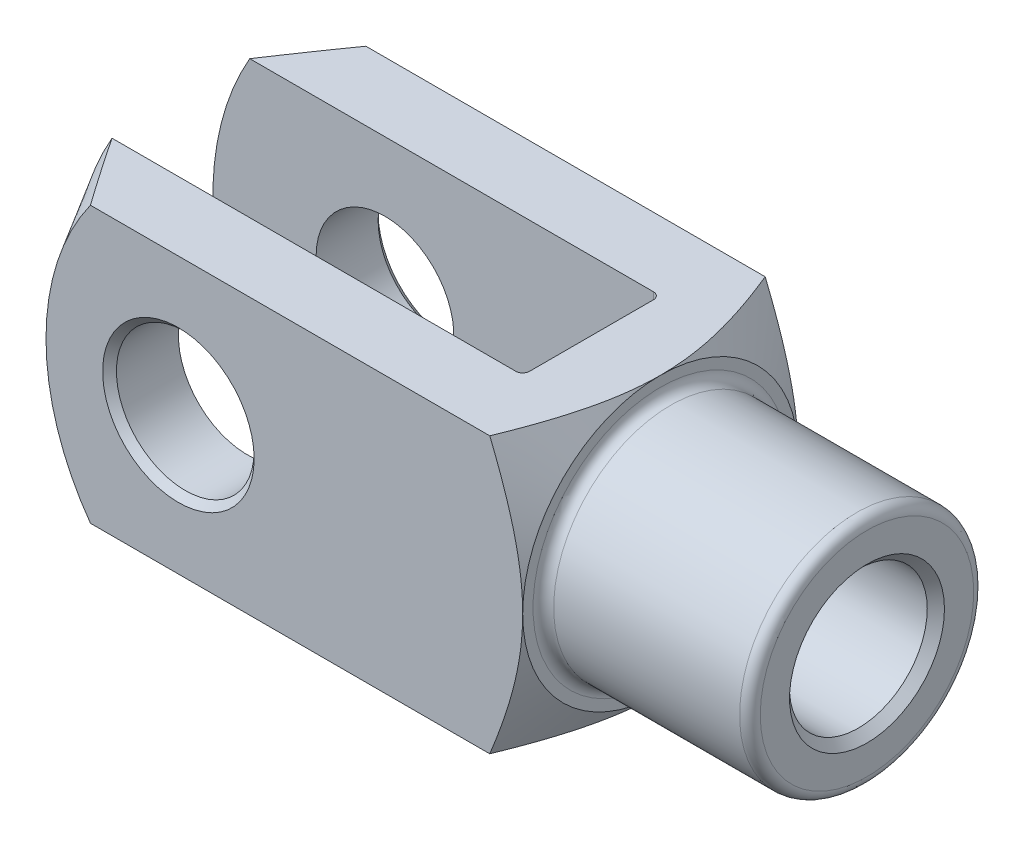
ISO-10303-21;
HEADER;
FILE_DESCRIPTION(('STEP AP214'),'2;1');
FILE_NAME('part.step','',(''),(''),'','','');
FILE_SCHEMA(('AUTOMOTIVE_DESIGN { 1 0 10303 214 1 1 1 1 }'));
ENDSEC;
DATA;
#1=APPLICATION_CONTEXT('core data for automotive mechanical design processes');
#2=APPLICATION_PROTOCOL_DEFINITION('international standard','automotive_design',2000,#1);
#3=PRODUCT_CONTEXT('',#1,'mechanical');
#4=PRODUCT('Part','Part','',(#3));
#5=PRODUCT_RELATED_PRODUCT_CATEGORY('part','',(#4));
#6=PRODUCT_DEFINITION_FORMATION('','',#4);
#7=PRODUCT_DEFINITION_CONTEXT('part definition',#1,'design');
#8=PRODUCT_DEFINITION('design','',#6,#7);
#9=PRODUCT_DEFINITION_SHAPE('','',#8);
#10=(LENGTH_UNIT() NAMED_UNIT(*) SI_UNIT(.MILLI.,.METRE.));
#11=(NAMED_UNIT(*) PLANE_ANGLE_UNIT() SI_UNIT($,.RADIAN.));
#12=(NAMED_UNIT(*) SI_UNIT($,.STERADIAN.) SOLID_ANGLE_UNIT());
#13=UNCERTAINTY_MEASURE_WITH_UNIT(LENGTH_MEASURE(1.E-05),#10,'distance_accuracy_value','');
#14=(GEOMETRIC_REPRESENTATION_CONTEXT(3) GLOBAL_UNCERTAINTY_ASSIGNED_CONTEXT((#13)) GLOBAL_UNIT_ASSIGNED_CONTEXT((#10,
#11,#12)) REPRESENTATION_CONTEXT('',''));
#15=CARTESIAN_POINT('',(0.,0.,0.));
#16=DIRECTION('',(0.,0.,1.));
#17=DIRECTION('',(1.,0.,0.));
#18=AXIS2_PLACEMENT_3D('',#15,#16,#17);
#19=CARTESIAN_POINT('',(-41.,-20.,-8.99999999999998));
#20=DIRECTION('',(0.,-1.,0.));
#21=DIRECTION('',(0.,0.,-1.));
#22=AXIS2_PLACEMENT_3D('',#19,#20,#21);
#23=CYLINDRICAL_SURFACE('',#22,1.);
#24=DIRECTION('',(0.,1.,0.));
#25=VECTOR('',#24,1.);
#26=CARTESIAN_POINT('',(-40.,-20.,-8.99999999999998));
#27=LINE('',#26,#25);
#28=CARTESIAN_POINT('',(-40.,-4.35889894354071,-8.99999999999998));
#29=VERTEX_POINT('',#28);
#30=CARTESIAN_POINT('',(-40.,-20.,-8.99999999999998));
#31=VERTEX_POINT('',#30);
#32=EDGE_CURVE('E358',#29,#31,#27,.F.);
#33=ORIENTED_EDGE('',*,*,#32,.F.);
#34=CARTESIAN_POINT('',(-40.,-4.35889894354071,-8.99999999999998));
#35=CARTESIAN_POINT('',(-40.0000151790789,-4.2865764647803,-9.03502940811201));
#36=CARTESIAN_POINT('',(-40.0018397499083,-4.2138483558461,-9.06917502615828));
#37=CARTESIAN_POINT('',(-40.0086750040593,-4.06774424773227,-9.13563818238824));
#38=CARTESIAN_POINT('',(-40.0136843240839,-3.99436853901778,-9.16795649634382));
#39=CARTESIAN_POINT('',(-40.0264446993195,-3.84721416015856,-9.23067336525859));
#40=CARTESIAN_POINT('',(-40.0341903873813,-3.77343655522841,-9.26107554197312));
#41=CARTESIAN_POINT('',(-40.0520865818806,-3.62542416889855,-9.32001323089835));
#42=CARTESIAN_POINT('',(-40.0622373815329,-3.55118933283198,-9.34854851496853));
#43=CARTESIAN_POINT('',(-40.0957491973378,-3.32854256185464,-9.43110737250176));
#44=CARTESIAN_POINT('',(-40.1222296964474,-3.17955672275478,-9.48235268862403));
#45=CARTESIAN_POINT('',(-40.1816529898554,-2.88046339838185,-9.57745203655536));
#46=CARTESIAN_POINT('',(-40.2145999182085,-2.73035525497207,-9.62130130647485));
#47=CARTESIAN_POINT('',(-40.2998777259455,-2.36825595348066,-9.71798906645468));
#48=CARTESIAN_POINT('',(-40.3546487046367,-2.15587492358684,-9.76725305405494));
#49=CARTESIAN_POINT('',(-40.4708728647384,-1.73020697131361,-9.85157380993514));
#50=CARTESIAN_POINT('',(-40.5323270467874,-1.51691991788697,-9.88662844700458));
#51=CARTESIAN_POINT('',(-40.723002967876,-0.876019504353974,-9.97086857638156));
#52=CARTESIAN_POINT('',(-40.8585728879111,-0.44723290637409,-9.99916563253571));
#53=CARTESIAN_POINT('',(-40.9959799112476,-0.012712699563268,-9.99999393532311));
#54=CARTESIAN_POINT('',(-40.9979899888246,-0.00635627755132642,-9.9999999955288));
#55=CARTESIAN_POINT('',(-41.,0.,-9.99999999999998));
#56=B_SPLINE_CURVE_WITH_KNOTS('',3,(#34,#35,#36,#37,#38,#39,#40,#41,#42,#43,#44,#45,#46,#47,#48,
#49,#50,#51,#52,#53,#54,#55),.UNSPECIFIED.,.F.,.F.,(4,2,2,2,2,2,2,2,2,2,4),(0.,
0.241022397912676,0.481941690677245,0.722391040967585,0.962869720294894,1.44176483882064,
1.9209671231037,2.594656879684,3.26844764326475,4.61560355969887,4.63560356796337),.UNSPECIFIED.);
#57=CARTESIAN_POINT('',(-41.,0.,-9.99999999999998));
#58=VERTEX_POINT('',#57);
#59=EDGE_CURVE('E389',#29,#58,#56,.T.);
#60=ORIENTED_EDGE('',*,*,#59,.T.);
#61=DIRECTION('',(0.,1.,0.));
#62=VECTOR('',#61,1.);
#63=CARTESIAN_POINT('',(-41.,20.,-9.99999999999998));
#64=LINE('',#63,#62);
#65=CARTESIAN_POINT('',(-41.,-20.,-9.99999999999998));
#66=VERTEX_POINT('',#65);
#67=EDGE_CURVE('E182',#66,#58,#64,.T.);
#68=ORIENTED_EDGE('',*,*,#67,.F.);
#69=CARTESIAN_POINT('',(-41.,-20.,-8.99999999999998));
#70=DIRECTION('',(0.,-1.,0.));
#71=DIRECTION('',(0.,0.,-1.));
#72=AXIS2_PLACEMENT_3D('',#69,#70,#71);
#73=CIRCLE('',#72,1.);
#74=EDGE_CURVE('E197',#31,#66,#73,.F.);
#75=ORIENTED_EDGE('',*,*,#74,.F.);
#76=EDGE_LOOP('',(#33,#60,#68,#75));
#77=FACE_BOUND('',#76,.T.);
#78=ADVANCED_FACE('F37',(#77),#23,.F.);
#79=CARTESIAN_POINT('',(-40.,-20.,-9.99999999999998));
#80=DIRECTION('',(1.,0.,0.));
#81=DIRECTION('',(0.,0.,-1.));
#82=AXIS2_PLACEMENT_3D('',#79,#80,#81);
#83=PLANE('',#82);
#84=CARTESIAN_POINT('',(-40.,20.,-8.99999999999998));
#85=VERTEX_POINT('',#84);
#86=CARTESIAN_POINT('',(-40.,4.35889894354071,-8.99999999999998));
#87=VERTEX_POINT('',#86);
#88=EDGE_CURVE('E374',#85,#87,#27,.F.);
#89=ORIENTED_EDGE('',*,*,#88,.T.);
#90=CARTESIAN_POINT('',(-40.,0.,0.));
#91=DIRECTION('',(1.,0.,0.));
#92=DIRECTION('',(0.,0.,-1.));
#93=AXIS2_PLACEMENT_3D('',#90,#91,#92);
#94=CIRCLE('',#93,10.);
#95=CARTESIAN_POINT('',(-40.,4.35889894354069,8.99999999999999));
#96=VERTEX_POINT('',#95);
#97=EDGE_CURVE('E418',#87,#96,#94,.T.);
#98=ORIENTED_EDGE('',*,*,#97,.T.);
#99=DIRECTION('',(0.,1.,0.));
#100=VECTOR('',#99,1.);
#101=CARTESIAN_POINT('',(-40.,20.,8.99999999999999));
#102=LINE('',#101,#100);
#103=CARTESIAN_POINT('',(-40.,20.,8.99999999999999));
#104=VERTEX_POINT('',#103);
#105=EDGE_CURVE('E160',#96,#104,#102,.T.);
#106=ORIENTED_EDGE('',*,*,#105,.T.);
#107=DIRECTION('',(0.,0.,-1.));
#108=VECTOR('',#107,1.);
#109=CARTESIAN_POINT('',(-40.,20.,-9.99999999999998));
#110=LINE('',#109,#108);
#111=EDGE_CURVE('E338',#104,#85,#110,.T.);
#112=ORIENTED_EDGE('',*,*,#111,.T.);
#113=EDGE_LOOP('',(#89,#98,#106,#112));
#114=FACE_BOUND('',#113,.T.);
#115=ADVANCED_FACE('F461',(#114),#83,.F.);
#116=CARTESIAN_POINT('',(-41.,-20.,8.99999999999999));
#117=DIRECTION('',(0.,-1.,0.));
#118=DIRECTION('',(0.,0.,-1.));
#119=AXIS2_PLACEMENT_3D('',#116,#117,#118);
#120=CYLINDRICAL_SURFACE('',#119,1.);
#121=ORIENTED_EDGE('',*,*,#105,.F.);
#122=CARTESIAN_POINT('',(-40.,4.35889894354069,8.99999999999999));
#123=CARTESIAN_POINT('',(-40.0000151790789,4.28657646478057,9.03502940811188));
#124=CARTESIAN_POINT('',(-40.0018397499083,4.21384835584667,9.06917502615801));
#125=CARTESIAN_POINT('',(-40.0086750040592,4.06774424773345,9.13563818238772));
#126=CARTESIAN_POINT('',(-40.0136843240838,3.99436853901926,9.16795649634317));
#127=CARTESIAN_POINT('',(-40.0264446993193,3.84721416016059,9.23067336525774));
#128=CARTESIAN_POINT('',(-40.034190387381,3.77343655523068,9.2610755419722));
#129=CARTESIAN_POINT('',(-40.0520865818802,3.6254241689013,9.32001323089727));
#130=CARTESIAN_POINT('',(-40.0622373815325,3.55118933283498,9.3485485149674));
#131=CARTESIAN_POINT('',(-40.0957491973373,3.32854256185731,9.43110737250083));
#132=CARTESIAN_POINT('',(-40.1222296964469,3.17955672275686,9.48235268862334));
#133=CARTESIAN_POINT('',(-40.1816529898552,2.88046339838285,9.57745203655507));
#134=CARTESIAN_POINT('',(-40.2145999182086,2.7303552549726,9.62130130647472));
#135=CARTESIAN_POINT('',(-40.2998777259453,2.36825595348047,9.7179890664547));
#136=CARTESIAN_POINT('',(-40.3546487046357,2.15587492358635,9.76725305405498));
#137=CARTESIAN_POINT('',(-40.4708728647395,1.73020697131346,9.85157380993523));
#138=CARTESIAN_POINT('',(-40.5323270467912,1.51691991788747,9.88662844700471));
#139=CARTESIAN_POINT('',(-40.7230029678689,0.876019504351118,9.97086857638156));
#140=CARTESIAN_POINT('',(-40.8585728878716,0.447232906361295,9.99916563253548));
#141=CARTESIAN_POINT('',(-40.9959799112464,0.0127126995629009,9.99999393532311));
#142=CARTESIAN_POINT('',(-40.997989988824,0.00635627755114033,9.99999999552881));
#143=CARTESIAN_POINT('',(-41.,0.,9.99999999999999));
#144=B_SPLINE_CURVE_WITH_KNOTS('',3,(#122,#123,#124,#125,#126,#127,#128,#129,#130,#131,#132,
#133,#134,#135,#136,#137,#138,#139,#140,#141,#142,#143),.UNSPECIFIED.,.F.,.F.,(4,2,2,2,2,2,2,2,
2,2,4),(0.,0.241022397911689,0.48194169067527,0.72239104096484,0.962869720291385,
1.44176483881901,1.92096712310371,2.59465687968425,3.26844764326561,4.61560355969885,
4.63560356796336),.UNSPECIFIED.);
#145=CARTESIAN_POINT('',(-41.,0.,9.99999999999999));
#146=VERTEX_POINT('',#145);
#147=EDGE_CURVE('E145',#96,#146,#144,.T.);
#148=ORIENTED_EDGE('',*,*,#147,.T.);
#149=DIRECTION('',(0.,1.,0.));
#150=VECTOR('',#149,1.);
#151=CARTESIAN_POINT('',(-41.,-20.,9.99999999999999));
#152=LINE('',#151,#150);
#153=CARTESIAN_POINT('',(-41.,20.,9.99999999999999));
#154=VERTEX_POINT('',#153);
#155=EDGE_CURVE('E159',#154,#146,#152,.F.);
#156=ORIENTED_EDGE('',*,*,#155,.F.);
#157=CARTESIAN_POINT('',(-41.,20.,8.99999999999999));
#158=DIRECTION('',(0.,1.,0.));
#159=DIRECTION('',(0.,0.,1.));
#160=AXIS2_PLACEMENT_3D('',#157,#158,#159);
#161=CIRCLE('',#160,1.);
#162=EDGE_CURVE('E189',#104,#154,#161,.F.);
#163=ORIENTED_EDGE('',*,*,#162,.F.);
#164=EDGE_LOOP('',(#121,#148,#156,#163));
#165=FACE_BOUND('',#164,.T.);
#166=ADVANCED_FACE('F156',(#165),#120,.F.);
#167=CARTESIAN_POINT('',(-105.,-20.,-9.99999999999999));
#168=DIRECTION('',(0.,0.,-1.));
#169=DIRECTION('',(-1.,0.,0.));
#170=AXIS2_PLACEMENT_3D('',#167,#168,#169);
#171=PLANE('',#170);
#172=CARTESIAN_POINT('',(-80.,0.,-9.99999999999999));
#173=DIRECTION('',(0.,0.,-1.));
#174=DIRECTION('',(-1.,0.,0.));
#175=AXIS2_PLACEMENT_3D('',#172,#173,#174);
#176=CIRCLE('',#175,9.99999999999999);
#177=CARTESIAN_POINT('',(-90.,0.,-9.99999999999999));
#178=VERTEX_POINT('',#177);
#179=EDGE_CURVE('E368',#178,#178,#176,.F.);
#180=ORIENTED_EDGE('',*,*,#179,.F.);
#181=EDGE_LOOP('',(#180));
#182=FACE_BOUND('',#181,.T.);
#183=CARTESIAN_POINT('',(-65.,0.,-9.99999999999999));
#184=DIRECTION('',(0.,0.,1.));
#185=DIRECTION('',(1.,0.,0.));
#186=AXIS2_PLACEMENT_3D('',#183,#184,#185);
#187=CIRCLE('',#186,40.);
#188=CARTESIAN_POINT('',(-99.6410161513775,20.,-9.99999999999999));
#189=VERTEX_POINT('',#188);
#190=CARTESIAN_POINT('',(-99.6410161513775,-20.,-9.99999999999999));
#191=VERTEX_POINT('',#190);
#192=EDGE_CURVE('E276',#189,#191,#187,.T.);
#193=ORIENTED_EDGE('',*,*,#192,.T.);
#194=DIRECTION('',(-1.,0.,0.));
#195=VECTOR('',#194,1.);
#196=CARTESIAN_POINT('',(-105.,-20.,-9.99999999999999));
#197=LINE('',#196,#195);
#198=EDGE_CURVE('E333',#66,#191,#197,.T.);
#199=ORIENTED_EDGE('',*,*,#198,.F.);
#200=ORIENTED_EDGE('',*,*,#67,.T.);
#201=CARTESIAN_POINT('',(-41.,20.,-9.99999999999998));
#202=VERTEX_POINT('',#201);
#203=EDGE_CURVE('E179',#58,#202,#64,.T.);
#204=ORIENTED_EDGE('',*,*,#203,.T.);
#205=DIRECTION('',(-1.,0.,0.));
#206=VECTOR('',#205,1.);
#207=CARTESIAN_POINT('',(-105.,20.,-9.99999999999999));
#208=LINE('',#207,#206);
#209=EDGE_CURVE('E346',#202,#189,#208,.T.);
#210=ORIENTED_EDGE('',*,*,#209,.T.);
#211=EDGE_LOOP('',(#193,#199,#200,#204,#210));
#212=FACE_BOUND('',#211,.T.);
#213=ADVANCED_FACE('F392',(#182,#212),#171,.F.);
#214=CARTESIAN_POINT('',(-105.,-20.,10.));
#215=DIRECTION('',(0.,0.,1.));
#216=DIRECTION('',(1.,0.,0.));
#217=AXIS2_PLACEMENT_3D('',#214,#215,#216);
#218=PLANE('',#217);
#219=CARTESIAN_POINT('',(-80.,0.,10.));
#220=DIRECTION('',(0.,0.,1.));
#221=DIRECTION('',(1.,0.,0.));
#222=AXIS2_PLACEMENT_3D('',#219,#220,#221);
#223=CIRCLE('',#222,9.99999999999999);
#224=CARTESIAN_POINT('',(-70.,0.,10.));
#225=VERTEX_POINT('',#224);
#226=EDGE_CURVE('E345',#225,#225,#223,.F.);
#227=ORIENTED_EDGE('',*,*,#226,.F.);
#228=EDGE_LOOP('',(#227));
#229=FACE_BOUND('',#228,.T.);
#230=DIRECTION('',(1.,0.,0.));
#231=VECTOR('',#230,1.);
#232=CARTESIAN_POINT('',(-105.,-20.,10.));
#233=LINE('',#232,#231);
#234=CARTESIAN_POINT('',(-99.6410161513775,-20.,10.));
#235=VERTEX_POINT('',#234);
#236=CARTESIAN_POINT('',(-41.,-20.,9.99999999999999));
#237=VERTEX_POINT('',#236);
#238=EDGE_CURVE('E337',#235,#237,#233,.T.);
#239=ORIENTED_EDGE('',*,*,#238,.F.);
#240=CARTESIAN_POINT('',(-65.,0.,10.));
#241=DIRECTION('',(0.,0.,1.));
#242=DIRECTION('',(1.,0.,0.));
#243=AXIS2_PLACEMENT_3D('',#240,#241,#242);
#244=CIRCLE('',#243,40.);
#245=CARTESIAN_POINT('',(-99.6410161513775,20.,10.));
#246=VERTEX_POINT('',#245);
#247=EDGE_CURVE('E416',#246,#235,#244,.T.);
#248=ORIENTED_EDGE('',*,*,#247,.F.);
#249=DIRECTION('',(1.,0.,0.));
#250=VECTOR('',#249,1.);
#251=CARTESIAN_POINT('',(-105.,20.,10.));
#252=LINE('',#251,#250);
#253=EDGE_CURVE('E176',#246,#154,#252,.T.);
#254=ORIENTED_EDGE('',*,*,#253,.T.);
#255=ORIENTED_EDGE('',*,*,#155,.T.);
#256=EDGE_CURVE('E164',#146,#237,#152,.F.);
#257=ORIENTED_EDGE('',*,*,#256,.T.);
#258=EDGE_LOOP('',(#239,#248,#254,#255,#257));
#259=FACE_BOUND('',#258,.T.);
#260=ADVANCED_FACE('F173',(#229,#259),#218,.F.);
#261=CARTESIAN_POINT('',(-105.,-20.,20.));
#262=DIRECTION('',(0.,0.,1.));
#263=DIRECTION('',(1.,0.,0.));
#264=AXIS2_PLACEMENT_3D('',#261,#262,#263);
#265=PLANE('',#264);
#266=CARTESIAN_POINT('',(-80.,0.,20.));
#267=DIRECTION('',(0.,0.,1.));
#268=DIRECTION('',(1.,0.,0.));
#269=AXIS2_PLACEMENT_3D('',#266,#267,#268);
#270=CIRCLE('',#269,11.);
#271=CARTESIAN_POINT('',(-69.,0.,20.));
#272=VERTEX_POINT('',#271);
#273=EDGE_CURVE('E228',#272,#272,#270,.F.);
#274=ORIENTED_EDGE('',*,*,#273,.T.);
#275=EDGE_LOOP('',(#274));
#276=FACE_BOUND('',#275,.T.);
#277=DIRECTION('',(1.,0.,0.));
#278=VECTOR('',#277,1.);
#279=CARTESIAN_POINT('',(-105.,20.,20.));
#280=LINE('',#279,#278);
#281=CARTESIAN_POINT('',(-92.7750448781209,20.,20.));
#282=VERTEX_POINT('',#281);
#283=CARTESIAN_POINT('',(-34.7829262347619,20.,20.));
#284=VERTEX_POINT('',#283);
#285=EDGE_CURVE('E365',#282,#284,#280,.T.);
#286=ORIENTED_EDGE('',*,*,#285,.F.);
#287=CARTESIAN_POINT('',(-65.,0.,20.));
#288=DIRECTION('',(0.,0.,1.));
#289=DIRECTION('',(1.,0.,0.));
#290=AXIS2_PLACEMENT_3D('',#287,#288,#289);
#291=CIRCLE('',#290,34.2264973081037);
#292=CARTESIAN_POINT('',(-92.7750448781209,-20.,20.));
#293=VERTEX_POINT('',#292);
#294=EDGE_CURVE('E61',#282,#293,#291,.T.);
#295=ORIENTED_EDGE('',*,*,#294,.T.);
#296=DIRECTION('',(1.,0.,0.));
#297=VECTOR('',#296,1.);
#298=CARTESIAN_POINT('',(-105.,-20.,20.));
#299=LINE('',#298,#297);
#300=CARTESIAN_POINT('',(-34.7829262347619,-20.,20.));
#301=VERTEX_POINT('',#300);
#302=EDGE_CURVE('E362',#293,#301,#299,.T.);
#303=ORIENTED_EDGE('',*,*,#302,.T.);
#304=CARTESIAN_POINT('',(-44.7117469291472,-40.8480870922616,20.));
#305=CARTESIAN_POINT('',(-44.4561917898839,-40.3552393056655,20.));
#306=CARTESIAN_POINT('',(-44.2013369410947,-39.8620284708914,20.));
#307=CARTESIAN_POINT('',(-43.693177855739,-38.874806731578,20.));
#308=CARTESIAN_POINT('',(-43.4398736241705,-38.3807958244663,20.));
#309=CARTESIAN_POINT('',(-42.6824888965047,-36.8974069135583,20.));
#310=CARTESIAN_POINT('',(-42.1809621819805,-35.9067224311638,20.));
#311=CARTESIAN_POINT('',(-41.18538005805,-33.9194417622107,20.));
#312=CARTESIAN_POINT('',(-40.6913391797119,-32.9228382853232,20.));
#313=CARTESIAN_POINT('',(-39.7136550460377,-30.9245603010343,20.));
#314=CARTESIAN_POINT('',(-39.2300116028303,-29.9228858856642,20.));
#315=CARTESIAN_POINT('',(-38.2464042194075,-27.8515018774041,20.));
#316=CARTESIAN_POINT('',(-37.7472668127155,-26.7813979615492,20.));
#317=CARTESIAN_POINT('',(-37.0128527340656,-25.1696896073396,20.));
#318=CARTESIAN_POINT('',(-36.7704219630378,-24.6313428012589,20.));
#319=CARTESIAN_POINT('',(-36.2910428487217,-23.5522150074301,20.));
#320=CARTESIAN_POINT('',(-36.0540944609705,-23.0114340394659,20.));
#321=CARTESIAN_POINT('',(-35.5865923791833,-21.9273871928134,20.));
#322=CARTESIAN_POINT('',(-35.356035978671,-21.3841224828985,20.));
#323=CARTESIAN_POINT('',(-34.9021820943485,-20.2945711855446,20.));
#324=CARTESIAN_POINT('',(-34.6788845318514,-19.748284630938,20.));
#325=CARTESIAN_POINT('',(-34.2407069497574,-18.6523948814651,20.));
#326=CARTESIAN_POINT('',(-34.0258261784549,-18.1027919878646,20.));
#327=CARTESIAN_POINT('',(-33.6058159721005,-16.999875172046,20.));
#328=CARTESIAN_POINT('',(-33.4006864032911,-16.4465613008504,20.));
#329=CARTESIAN_POINT('',(-32.9584948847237,-15.2154115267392,20.));
#330=CARTESIAN_POINT('',(-32.724154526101,-14.5365922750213,20.));
#331=CARTESIAN_POINT('',(-32.2756396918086,-13.1723527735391,20.));
#332=CARTESIAN_POINT('',(-32.061463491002,-12.4869330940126,20.));
#333=CARTESIAN_POINT('',(-31.6572524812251,-11.1089764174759,20.));
#334=CARTESIAN_POINT('',(-31.4672171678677,-10.4164395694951,20.));
#335=CARTESIAN_POINT('',(-31.115826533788,-9.02406913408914,20.));
#336=CARTESIAN_POINT('',(-30.9544708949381,-8.32423562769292,20.));
#337=CARTESIAN_POINT('',(-30.6686985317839,-6.93411418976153,20.));
#338=CARTESIAN_POINT('',(-30.543503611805,-6.24398781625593,20.));
#339=CARTESIAN_POINT('',(-30.3295158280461,-4.85806653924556,20.));
#340=CARTESIAN_POINT('',(-30.2407217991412,-4.16227181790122,20.));
#341=CARTESIAN_POINT('',(-30.1032474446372,-2.76713808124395,20.));
#342=CARTESIAN_POINT('',(-30.0545409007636,-2.06780168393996,20.));
#343=CARTESIAN_POINT('',(-29.9993902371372,-0.667457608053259,20.));
#344=CARTESIAN_POINT('',(-29.9929446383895,0.033550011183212,20.));
#345=CARTESIAN_POINT('',(-30.0215257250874,1.38358015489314,20.));
#346=CARTESIAN_POINT('',(-30.053564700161,2.03266864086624,20.));
#347=CARTESIAN_POINT('',(-30.1529107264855,3.32811214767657,20.));
#348=CARTESIAN_POINT('',(-30.2202176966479,3.97446717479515,20.));
#349=CARTESIAN_POINT('',(-30.3876322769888,5.26320613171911,20.));
#350=CARTESIAN_POINT('',(-30.4877568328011,5.90558783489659,20.));
#351=CARTESIAN_POINT('',(-30.7175054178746,7.18501977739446,20.));
#352=CARTESIAN_POINT('',(-30.8471302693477,7.82206986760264,20.));
#353=CARTESIAN_POINT('',(-31.1364002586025,9.10865741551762,20.));
#354=CARTESIAN_POINT('',(-31.2968057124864,9.75802261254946,20.));
#355=CARTESIAN_POINT('',(-31.6411635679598,11.0504361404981,20.));
#356=CARTESIAN_POINT('',(-31.8251161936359,11.6934844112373,20.));
#357=CARTESIAN_POINT('',(-32.2130089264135,12.9734650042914,20.));
#358=CARTESIAN_POINT('',(-32.4169481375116,13.6103975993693,20.));
#359=CARTESIAN_POINT('',(-32.7355110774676,14.5615046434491,20.));
#360=CARTESIAN_POINT('',(-32.8438059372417,14.8778200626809,20.));
#361=CARTESIAN_POINT('',(-33.0642784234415,15.5090943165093,20.));
#362=CARTESIAN_POINT('',(-33.1764560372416,15.8240531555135,20.));
#363=CARTESIAN_POINT('',(-33.5368964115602,16.8182188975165,20.));
#364=CARTESIAN_POINT('',(-33.7917035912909,17.4950585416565,20.));
#365=CARTESIAN_POINT('',(-34.315152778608,18.8433829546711,20.));
#366=CARTESIAN_POINT('',(-34.5837956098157,19.5148674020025,20.));
#367=CARTESIAN_POINT('',(-35.1326821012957,20.8532445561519,20.));
#368=CARTESIAN_POINT('',(-35.412928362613,21.5201361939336,20.));
#369=CARTESIAN_POINT('',(-35.9830913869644,22.8497479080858,20.));
#370=CARTESIAN_POINT('',(-36.2730079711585,23.5124680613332,20.));
#371=CARTESIAN_POINT('',(-36.86125118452,24.8348444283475,20.));
#372=CARTESIAN_POINT('',(-37.1595848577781,25.4944975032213,20.));
#373=CARTESIAN_POINT('',(-37.7631804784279,26.8106245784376,20.));
#374=CARTESIAN_POINT('',(-38.0684424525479,27.467098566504,20.));
#375=CARTESIAN_POINT('',(-38.6848375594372,28.7771877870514,20.));
#376=CARTESIAN_POINT('',(-38.9959700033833,29.4308033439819,20.));
#377=CARTESIAN_POINT('',(-39.6233091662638,30.735596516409,20.));
#378=CARTESIAN_POINT('',(-39.9395159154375,31.3867741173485,20.));
#379=CARTESIAN_POINT('',(-40.896609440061,33.3410563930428,20.));
#380=CARTESIAN_POINT('',(-41.5440877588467,34.6409339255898,20.));
#381=CARTESIAN_POINT('',(-42.8522843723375,37.234022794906,20.));
#382=CARTESIAN_POINT('',(-43.5130029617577,38.5272339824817,20.));
#383=CARTESIAN_POINT('',(-44.8443480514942,41.1077325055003,20.));
#384=CARTESIAN_POINT('',(-45.5149695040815,42.3950224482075,20.));
#385=CARTESIAN_POINT('',(-46.8642487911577,44.9653657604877,20.));
#386=CARTESIAN_POINT('',(-47.5429065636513,46.2484191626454,20.));
#387=CARTESIAN_POINT('',(-48.8053932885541,48.6208089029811,20.));
#388=CARTESIAN_POINT('',(-49.3883375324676,49.7106165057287,20.));
#389=CARTESIAN_POINT('',(-50.5581313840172,51.8881346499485,20.));
#390=CARTESIAN_POINT('',(-51.1449809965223,52.9758451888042,20.));
#391=CARTESIAN_POINT('',(-52.3220562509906,55.1496344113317,20.));
#392=CARTESIAN_POINT('',(-52.9122823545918,56.2357128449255,20.));
#393=CARTESIAN_POINT('',(-54.0955388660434,58.4063411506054,20.));
#394=CARTESIAN_POINT('',(-54.6885692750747,59.4908910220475,20.));
#395=CARTESIAN_POINT('',(-55.8736310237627,61.6524632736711,20.));
#396=CARTESIAN_POINT('',(-56.4656486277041,62.7294931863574,20.));
#397=CARTESIAN_POINT('',(-57.6517398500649,64.8824205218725,20.));
#398=CARTESIAN_POINT('',(-58.2458134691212,65.9583179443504,20.));
#399=CARTESIAN_POINT('',(-59.4356534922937,68.108954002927,20.));
#400=CARTESIAN_POINT('',(-60.0314196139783,69.1836927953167,20.));
#401=CARTESIAN_POINT('',(-61.2245219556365,71.3322969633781,20.));
#402=CARTESIAN_POINT('',(-61.8218581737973,72.4061623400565,20.));
#403=CARTESIAN_POINT('',(-62.4198720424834,73.4796497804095,20.));
#404=B_SPLINE_CURVE_WITH_KNOTS('',3,(#304,#305,#306,#307,#308,#309,#310,#311,#312,#313,#314,
#315,#316,#317,#318,#319,#320,#321,#322,#323,#324,#325,#326,#327,#328,#329,#330,#331,#332,#333,
#334,#335,#336,#337,#338,#339,#340,#341,#342,#343,#344,#345,#346,#347,#348,#349,#350,#351,#352,
#353,#354,#355,#356,#357,#358,#359,#360,#361,#362,#363,#364,#365,#366,#367,#368,#369,#370,#371,
#372,#373,#374,#375,#376,#377,#378,#379,#380,#381,#382,#383,#384,#385,#386,#387,#388,#389,#390,
#391,#392,#393,#394,#395,#396,#397,#398,#399,#400,#401,#402,#403),.UNSPECIFIED.,.F.,.F.,(4,2,2,
2,2,2,2,2,2,2,2,2,2,2,2,2,2,2,2,2,2,2,2,2,2,2,2,2,2,2,2,2,2,2,2,2,2,2,2,2,2,2,2,2,2,2,2,2,2,4),
(0.,1.66549183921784,3.3309890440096,6.66215149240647,9.99911470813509,13.3360175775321,
16.8782159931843,18.6494369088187,20.4206434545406,22.1910882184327,23.961513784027,
25.7317808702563,27.5020236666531,29.6561476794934,31.8100872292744,33.9639817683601,
36.117852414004,38.2211628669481,40.3244059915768,42.4262724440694,44.5280653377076,
46.4767082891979,48.4253467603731,50.3749930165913,52.324693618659,54.3308265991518,
56.3369786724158,58.3430408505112,59.346040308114,60.3490365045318,62.5184742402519,
64.6880412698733,66.8580972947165,69.0281132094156,71.2000024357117,73.3719000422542,
75.5435443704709,77.7152016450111,82.0717130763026,86.4283215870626,90.7827812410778,
95.1372073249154,98.8449661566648,102.552729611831,106.261012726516,109.969297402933,
113.656340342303,117.343384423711,121.02984567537,124.716302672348),.UNSPECIFIED.);
#405=CARTESIAN_POINT('',(-30.,0.,20.));
#406=VERTEX_POINT('',#405);
#407=EDGE_CURVE('E305',#406,#301,#404,.F.);
#408=ORIENTED_EDGE('',*,*,#407,.F.);
#409=EDGE_CURVE('E303',#284,#406,#404,.F.);
#410=ORIENTED_EDGE('',*,*,#409,.F.);
#411=EDGE_LOOP('',(#286,#295,#303,#408,#410));
#412=FACE_BOUND('',#411,.T.);
#413=ADVANCED_FACE('F287',(#276,#412),#265,.T.);
#414=CARTESIAN_POINT('',(-105.,-20.,20.));
#415=DIRECTION('',(0.,-1.,0.));
#416=DIRECTION('',(0.,0.,-1.));
#417=AXIS2_PLACEMENT_3D('',#414,#415,#416);
#418=PLANE('',#417);
#419=ORIENTED_EDGE('',*,*,#198,.T.);
#420=CARTESIAN_POINT('',(-115.464255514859,-20.,14.7388337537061));
#421=CARTESIAN_POINT('',(-114.977726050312,-20.,13.9554262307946));
#422=CARTESIAN_POINT('',(-114.490511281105,-20.,13.1724443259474));
#423=CARTESIAN_POINT('',(-113.514581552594,-20.,11.6074156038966));
#424=CARTESIAN_POINT('',(-113.025866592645,-20.,10.8253687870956));
#425=CARTESIAN_POINT('',(-111.557258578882,-20.,8.48072725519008));
#426=CARTESIAN_POINT('',(-110.574921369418,-20.,6.9196620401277));
#427=CARTESIAN_POINT('',(-108.601276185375,-20.,3.80059817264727));
#428=CARTESIAN_POINT('',(-107.609958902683,-20.,2.24260540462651));
#429=CARTESIAN_POINT('',(-106.115876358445,-20.,-0.0898192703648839));
#430=CARTESIAN_POINT('',(-105.616667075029,-20.,-0.86652930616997));
#431=CARTESIAN_POINT('',(-104.615610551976,-20.,-2.41825426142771));
#432=CARTESIAN_POINT('',(-104.113763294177,-20.,-3.19326916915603));
#433=CARTESIAN_POINT('',(-102.561953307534,-20.,-5.57992347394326));
#434=CARTESIAN_POINT('',(-101.50712682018,-20.,-7.18841108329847));
#435=CARTESIAN_POINT('',(-99.912924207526,-20.,-9.59319983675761));
#436=CARTESIAN_POINT('',(-99.3795310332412,-20.,-10.3934700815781));
#437=CARTESIAN_POINT('',(-98.3082095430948,-20.,-11.9909680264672));
#438=CARTESIAN_POINT('',(-97.7702812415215,-20.,-12.7881957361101));
#439=CARTESIAN_POINT('',(-96.6896618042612,-20.,-14.3785600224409));
#440=CARTESIAN_POINT('',(-96.1469744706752,-20.,-15.1716991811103));
#441=CARTESIAN_POINT('',(-95.055691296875,-20.,-16.7539080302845));
#442=CARTESIAN_POINT('',(-94.5070954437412,-20.,-17.5429777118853));
#443=CARTESIAN_POINT('',(-93.4031123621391,-20.,-19.1163023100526));
#444=CARTESIAN_POINT('',(-92.847725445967,-20.,-19.9005574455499));
#445=CARTESIAN_POINT('',(-91.7290307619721,-20.,-21.4633921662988));
#446=CARTESIAN_POINT('',(-91.1657230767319,-20.,-22.2419718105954));
#447=CARTESIAN_POINT('',(-90.0351027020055,-20.,-23.7851048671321));
#448=CARTESIAN_POINT('',(-89.4678762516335,-20.,-24.5497213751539));
#449=CARTESIAN_POINT('',(-88.3226234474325,-20.,-26.0708599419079));
#450=CARTESIAN_POINT('',(-87.7445968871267,-20.,-26.8273818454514));
#451=CARTESIAN_POINT('',(-86.5748512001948,-20.,-28.331458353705));
#452=CARTESIAN_POINT('',(-85.9831143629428,-20.,-29.0789992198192));
#453=CARTESIAN_POINT('',(-84.7840499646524,-20.,-30.5614329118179));
#454=CARTESIAN_POINT('',(-84.1767232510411,-20.,-31.2963264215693));
#455=CARTESIAN_POINT('',(-82.9493347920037,-20.,-32.7424372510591));
#456=CARTESIAN_POINT('',(-82.3294704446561,-20.,-33.4538210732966));
#457=CARTESIAN_POINT('',(-81.3821904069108,-20.,-34.5053301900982));
#458=CARTESIAN_POINT('',(-81.0634648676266,-20.,-34.8532924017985));
#459=CARTESIAN_POINT('',(-80.4195061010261,-20.,-35.5431342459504));
#460=CARTESIAN_POINT('',(-80.0942730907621,-20.,-35.8850140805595));
#461=CARTESIAN_POINT('',(-79.4372350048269,-20.,-36.5609344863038));
#462=CARTESIAN_POINT('',(-79.1054461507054,-20.,-36.894990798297));
#463=CARTESIAN_POINT('',(-78.4336725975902,-20.,-37.5548111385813));
#464=CARTESIAN_POINT('',(-78.0936875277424,-20.,-37.8805747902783));
#465=CARTESIAN_POINT('',(-77.4046957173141,-20.,-38.5220472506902));
#466=CARTESIAN_POINT('',(-77.0556941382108,-20.,-38.8377615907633));
#467=CARTESIAN_POINT('',(-76.3473531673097,-20.,-39.4573309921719));
#468=CARTESIAN_POINT('',(-75.9880153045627,-20.,-39.7611877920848));
#469=CARTESIAN_POINT('',(-75.4337644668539,-20.,-40.2114960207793));
#470=CARTESIAN_POINT('',(-75.2431118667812,-20.,-40.3632010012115));
#471=CARTESIAN_POINT('',(-74.8584870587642,-20.,-40.6623387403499));
#472=CARTESIAN_POINT('',(-74.6645148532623,-20.,-40.8097715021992));
#473=CARTESIAN_POINT('',(-74.0772413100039,-20.,-41.2450393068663));
#474=CARTESIAN_POINT('',(-73.6786341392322,-20.,-41.5258020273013));
#475=CARTESIAN_POINT('',(-72.8661414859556,-20.,-42.0636748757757));
#476=CARTESIAN_POINT('',(-72.452268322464,-20.,-42.3208035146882));
#477=CARTESIAN_POINT('',(-71.607700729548,-20.,-42.8058851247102));
#478=CARTESIAN_POINT('',(-71.1770107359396,-20.,-43.0338457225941));
#479=CARTESIAN_POINT('',(-70.3985594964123,-20.,-43.4056496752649));
#480=CARTESIAN_POINT('',(-70.0543057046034,-20.,-43.5568168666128));
#481=CARTESIAN_POINT('',(-69.3557183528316,-20.,-43.8338983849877));
#482=CARTESIAN_POINT('',(-69.0013856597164,-20.,-43.9598148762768));
#483=CARTESIAN_POINT('',(-68.2841094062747,-20.,-44.1824113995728));
#484=CARTESIAN_POINT('',(-67.9211785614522,-20.,-44.2791320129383));
#485=CARTESIAN_POINT('',(-67.188106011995,-20.,-44.4400017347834));
#486=CARTESIAN_POINT('',(-66.8179646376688,-20.,-44.5041523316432));
#487=CARTESIAN_POINT('',(-66.0694904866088,-20.,-44.5976048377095));
#488=CARTESIAN_POINT('',(-65.6911128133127,-20.,-44.6265519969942));
#489=CARTESIAN_POINT('',(-64.9333496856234,-20.,-44.6470380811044));
#490=CARTESIAN_POINT('',(-64.5539642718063,-20.,-44.6385784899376));
#491=CARTESIAN_POINT('',(-63.797786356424,-20.,-44.5846599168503));
#492=CARTESIAN_POINT('',(-63.4209943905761,-20.,-44.5391935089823));
#493=CARTESIAN_POINT('',(-62.673309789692,-20.,-44.4133535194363));
#494=CARTESIAN_POINT('',(-62.302418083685,-20.,-44.3329744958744));
#495=CARTESIAN_POINT('',(-61.5010820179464,-20.,-44.1227716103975));
#496=CARTESIAN_POINT('',(-61.0723250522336,-20.,-43.9865486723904));
#497=CARTESIAN_POINT('',(-60.2287155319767,-20.,-43.6760654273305));
#498=CARTESIAN_POINT('',(-59.8138708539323,-20.,-43.5017839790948));
#499=CARTESIAN_POINT('',(-59.2021903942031,-20.,-43.2164310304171));
#500=CARTESIAN_POINT('',(-58.9997370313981,-20.,-43.1171417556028));
#501=CARTESIAN_POINT('',(-58.5986091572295,-20.,-42.9113932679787));
#502=CARTESIAN_POINT('',(-58.3999330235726,-20.,-42.8049372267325));
#503=CARTESIAN_POINT('',(-58.0062245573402,-20.,-42.5855142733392));
#504=CARTESIAN_POINT('',(-57.8111921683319,-20.,-42.4725474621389));
#505=CARTESIAN_POINT('',(-57.424640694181,-20.,-42.2407087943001));
#506=CARTESIAN_POINT('',(-57.233122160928,-20.,-42.1218360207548));
#507=CARTESIAN_POINT('',(-56.539242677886,-20.,-41.67758758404));
#508=CARTESIAN_POINT('',(-56.0471261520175,-20.,-41.3361114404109));
#509=CARTESIAN_POINT('',(-55.0840622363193,-20.,-40.6244535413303));
#510=CARTESIAN_POINT('',(-54.613125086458,-20.,-40.2542581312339));
#511=CARTESIAN_POINT('',(-53.6888042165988,-20.,-39.4909076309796));
#512=CARTESIAN_POINT('',(-53.2354560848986,-20.,-39.0977096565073));
#513=CARTESIAN_POINT('',(-52.3447584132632,-20.,-38.2938363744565));
#514=CARTESIAN_POINT('',(-51.9074062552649,-20.,-37.8831639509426));
#515=CARTESIAN_POINT('',(-51.043477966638,-20.,-37.0449994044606));
#516=CARTESIAN_POINT('',(-50.6169935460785,-20.,-36.6174131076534));
#517=CARTESIAN_POINT('',(-49.7759134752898,-20.,-35.7507127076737));
#518=CARTESIAN_POINT('',(-49.3613182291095,-20.,-35.3115982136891));
#519=CARTESIAN_POINT('',(-48.542832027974,-20.,-34.4243699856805));
#520=CARTESIAN_POINT('',(-48.1389304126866,-20.,-33.9762660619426));
#521=CARTESIAN_POINT('',(-47.3400472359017,-20.,-33.0722099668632));
#522=CARTESIAN_POINT('',(-46.9450655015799,-20.,-32.6162579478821));
#523=CARTESIAN_POINT('',(-46.0007892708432,-20.,-31.5074230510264));
#524=CARTESIAN_POINT('',(-45.4553790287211,-20.,-30.8512338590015));
#525=CARTESIAN_POINT('',(-44.3773944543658,-20.,-29.5282176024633));
#526=CARTESIAN_POINT('',(-43.8448226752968,-20.,-28.8613884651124));
#527=CARTESIAN_POINT('',(-42.7986511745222,-20.,-27.5294654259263));
#528=CARTESIAN_POINT('',(-42.2848857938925,-20.,-26.8645014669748));
#529=CARTESIAN_POINT('',(-41.5210718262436,-20.,-25.8620207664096));
#530=CARTESIAN_POINT('',(-41.2676429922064,-20.,-25.5270710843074));
#531=CARTESIAN_POINT('',(-40.7628770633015,-20.,-24.8556040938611));
#532=CARTESIAN_POINT('',(-40.5115399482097,-20.,-24.519086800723));
#533=CARTESIAN_POINT('',(-40.2611662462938,-20.,-24.1818536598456));
#534=B_SPLINE_CURVE_WITH_KNOTS('',3,(#420,#421,#422,#423,#424,#425,#426,#427,#428,#429,#430,
#431,#432,#433,#434,#435,#436,#437,#438,#439,#440,#441,#442,#443,#444,#445,#446,#447,#448,#449,
#450,#451,#452,#453,#454,#455,#456,#457,#458,#459,#460,#461,#462,#463,#464,#465,#466,#467,#468,
#469,#470,#471,#472,#473,#474,#475,#476,#477,#478,#479,#480,#481,#482,#483,#484,#485,#486,#487,
#488,#489,#490,#491,#492,#493,#494,#495,#496,#497,#498,#499,#500,#501,#502,#503,#504,#505,#506,
#507,#508,#509,#510,#511,#512,#513,#514,#515,#516,#517,#518,#519,#520,#521,#522,#523,#524,#525,
#526,#527,#528,#529,#530,#531,#532,#533),.UNSPECIFIED.,.F.,.F.,(4,2,2,2,2,2,2,2,2,2,2,2,2,2,2,2,
2,2,2,2,2,2,2,2,2,2,2,2,2,2,2,2,2,2,2,2,2,2,2,2,2,2,2,2,2,2,2,2,2,2,2,2,2,2,2,2,4),(0.,
2.76657575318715,5.53315269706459,11.0664145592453,16.6062810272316,19.3761848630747,
22.1461077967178,27.9165467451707,30.8017500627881,33.6869442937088,36.5700122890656,
39.453086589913,42.3360288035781,45.2189409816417,48.0749879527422,50.9310895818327,
53.7911127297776,56.6509807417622,59.4811890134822,60.8967393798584,62.3122426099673,
63.7245983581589,65.1370181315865,66.5486465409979,67.9600671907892,68.6909476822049,
69.4218276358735,70.8837854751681,72.3445883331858,73.8050084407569,74.9321155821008,
76.0591260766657,77.1845627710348,78.3099480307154,79.446582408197,80.5831716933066,
81.719989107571,82.8569837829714,84.2044814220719,85.5527294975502,86.2290826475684,
86.9051384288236,87.5811837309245,88.2573343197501,90.0527538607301,91.849032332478,
93.6487735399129,95.4482188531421,97.2597072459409,99.0712571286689,100.880927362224,
102.690562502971,105.250134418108,107.810211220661,110.331064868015,111.591120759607,
112.851164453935),.UNSPECIFIED.);
#535=CARTESIAN_POINT('',(-92.775044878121,-20.,-20.));
#536=VERTEX_POINT('',#535);
#537=EDGE_CURVE('E275',#191,#536,#534,.T.);
#538=ORIENTED_EDGE('',*,*,#537,.T.);
#539=DIRECTION('',(1.,0.,0.));
#540=VECTOR('',#539,1.);
#541=CARTESIAN_POINT('',(-105.,-20.,-20.));
#542=LINE('',#541,#540);
#543=CARTESIAN_POINT('',(-34.7829262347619,-20.,-20.));
#544=VERTEX_POINT('',#543);
#545=EDGE_CURVE('E359',#536,#544,#542,.T.);
#546=ORIENTED_EDGE('',*,*,#545,.T.);
#547=CARTESIAN_POINT('',(-44.7117469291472,-20.,-40.8480870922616));
#548=CARTESIAN_POINT('',(-44.4561917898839,-20.,-40.3552393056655));
#549=CARTESIAN_POINT('',(-44.2013369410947,-20.,-39.8620284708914));
#550=CARTESIAN_POINT('',(-43.693177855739,-20.,-38.874806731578));
#551=CARTESIAN_POINT('',(-43.4398736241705,-20.,-38.3807958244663));
#552=CARTESIAN_POINT('',(-42.6824888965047,-20.,-36.8974069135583));
#553=CARTESIAN_POINT('',(-42.1809621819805,-20.,-35.9067224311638));
#554=CARTESIAN_POINT('',(-41.18538005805,-20.,-33.9194417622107));
#555=CARTESIAN_POINT('',(-40.6913391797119,-20.,-32.9228382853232));
#556=CARTESIAN_POINT('',(-39.7136550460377,-20.,-30.9245603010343));
#557=CARTESIAN_POINT('',(-39.2300116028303,-20.,-29.9228858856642));
#558=CARTESIAN_POINT('',(-38.2464042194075,-20.,-27.8515018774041));
#559=CARTESIAN_POINT('',(-37.7472668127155,-20.,-26.7813979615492));
#560=CARTESIAN_POINT('',(-37.0128527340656,-20.,-25.1696896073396));
#561=CARTESIAN_POINT('',(-36.7704219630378,-20.,-24.6313428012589));
#562=CARTESIAN_POINT('',(-36.2910428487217,-20.,-23.5522150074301));
#563=CARTESIAN_POINT('',(-36.0540944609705,-20.,-23.0114340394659));
#564=CARTESIAN_POINT('',(-35.5865923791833,-20.,-21.9273871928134));
#565=CARTESIAN_POINT('',(-35.356035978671,-20.,-21.3841224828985));
#566=CARTESIAN_POINT('',(-34.9021820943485,-20.,-20.2945711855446));
#567=CARTESIAN_POINT('',(-34.6788845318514,-20.,-19.748284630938));
#568=CARTESIAN_POINT('',(-34.2407069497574,-20.,-18.6523948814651));
#569=CARTESIAN_POINT('',(-34.0258261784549,-20.,-18.1027919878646));
#570=CARTESIAN_POINT('',(-33.6058159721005,-20.,-16.999875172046));
#571=CARTESIAN_POINT('',(-33.4006864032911,-20.,-16.4465613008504));
#572=CARTESIAN_POINT('',(-32.9584948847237,-20.,-15.2154115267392));
#573=CARTESIAN_POINT('',(-32.724154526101,-20.,-14.5365922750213));
#574=CARTESIAN_POINT('',(-32.2756396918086,-20.,-13.1723527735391));
#575=CARTESIAN_POINT('',(-32.061463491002,-20.,-12.4869330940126));
#576=CARTESIAN_POINT('',(-31.6572524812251,-20.,-11.1089764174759));
#577=CARTESIAN_POINT('',(-31.4672171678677,-20.,-10.4164395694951));
#578=CARTESIAN_POINT('',(-31.115826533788,-20.,-9.02406913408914));
#579=CARTESIAN_POINT('',(-30.9544708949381,-20.,-8.32423562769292));
#580=CARTESIAN_POINT('',(-30.6686985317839,-20.,-6.93411418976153));
#581=CARTESIAN_POINT('',(-30.543503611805,-20.,-6.24398781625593));
#582=CARTESIAN_POINT('',(-30.3295158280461,-20.,-4.85806653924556));
#583=CARTESIAN_POINT('',(-30.2407217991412,-20.,-4.16227181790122));
#584=CARTESIAN_POINT('',(-30.1032474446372,-20.,-2.76713808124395));
#585=CARTESIAN_POINT('',(-30.0545409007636,-20.,-2.06780168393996));
#586=CARTESIAN_POINT('',(-29.9993902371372,-20.,-0.667457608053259));
#587=CARTESIAN_POINT('',(-29.9929446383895,-20.,0.033550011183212));
#588=CARTESIAN_POINT('',(-30.0215257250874,-20.,1.38358015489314));
#589=CARTESIAN_POINT('',(-30.053564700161,-20.,2.03266864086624));
#590=CARTESIAN_POINT('',(-30.1529107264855,-20.,3.32811214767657));
#591=CARTESIAN_POINT('',(-30.2202176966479,-20.,3.97446717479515));
#592=CARTESIAN_POINT('',(-30.3876322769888,-20.,5.26320613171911));
#593=CARTESIAN_POINT('',(-30.4877568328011,-20.,5.90558783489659));
#594=CARTESIAN_POINT('',(-30.7175054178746,-20.,7.18501977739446));
#595=CARTESIAN_POINT('',(-30.8471302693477,-20.,7.82206986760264));
#596=CARTESIAN_POINT('',(-31.1364002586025,-20.,9.10865741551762));
#597=CARTESIAN_POINT('',(-31.2968057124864,-20.,9.75802261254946));
#598=CARTESIAN_POINT('',(-31.6411635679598,-20.,11.0504361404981));
#599=CARTESIAN_POINT('',(-31.8251161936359,-20.,11.6934844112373));
#600=CARTESIAN_POINT('',(-32.2130089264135,-20.,12.9734650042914));
#601=CARTESIAN_POINT('',(-32.4169481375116,-20.,13.6103975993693));
#602=CARTESIAN_POINT('',(-32.7355110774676,-20.,14.5615046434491));
#603=CARTESIAN_POINT('',(-32.8438059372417,-20.,14.8778200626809));
#604=CARTESIAN_POINT('',(-33.0642784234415,-20.,15.5090943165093));
#605=CARTESIAN_POINT('',(-33.1764560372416,-20.,15.8240531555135));
#606=CARTESIAN_POINT('',(-33.5368964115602,-20.,16.8182188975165));
#607=CARTESIAN_POINT('',(-33.7917035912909,-20.,17.4950585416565));
#608=CARTESIAN_POINT('',(-34.315152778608,-20.,18.8433829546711));
#609=CARTESIAN_POINT('',(-34.5837956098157,-20.,19.5148674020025));
#610=CARTESIAN_POINT('',(-35.1326821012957,-20.,20.8532445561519));
#611=CARTESIAN_POINT('',(-35.412928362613,-20.,21.5201361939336));
#612=CARTESIAN_POINT('',(-35.9830913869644,-20.,22.8497479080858));
#613=CARTESIAN_POINT('',(-36.2730079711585,-20.,23.5124680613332));
#614=CARTESIAN_POINT('',(-36.86125118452,-20.,24.8348444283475));
#615=CARTESIAN_POINT('',(-37.1595848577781,-20.,25.4944975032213));
#616=CARTESIAN_POINT('',(-37.7631804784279,-20.,26.8106245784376));
#617=CARTESIAN_POINT('',(-38.0684424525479,-20.,27.467098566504));
#618=CARTESIAN_POINT('',(-38.6848375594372,-20.,28.7771877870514));
#619=CARTESIAN_POINT('',(-38.9959700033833,-20.,29.4308033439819));
#620=CARTESIAN_POINT('',(-39.6233091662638,-20.,30.735596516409));
#621=CARTESIAN_POINT('',(-39.9395159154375,-20.,31.3867741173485));
#622=CARTESIAN_POINT('',(-40.896609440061,-20.,33.3410563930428));
#623=CARTESIAN_POINT('',(-41.5440877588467,-20.,34.6409339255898));
#624=CARTESIAN_POINT('',(-42.8522843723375,-20.,37.234022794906));
#625=CARTESIAN_POINT('',(-43.5130029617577,-20.,38.5272339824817));
#626=CARTESIAN_POINT('',(-44.8443480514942,-20.,41.1077325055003));
#627=CARTESIAN_POINT('',(-45.5149695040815,-20.,42.3950224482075));
#628=CARTESIAN_POINT('',(-46.8642487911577,-20.,44.9653657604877));
#629=CARTESIAN_POINT('',(-47.5429065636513,-20.,46.2484191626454));
#630=CARTESIAN_POINT('',(-48.8053932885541,-20.,48.6208089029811));
#631=CARTESIAN_POINT('',(-49.3883375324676,-20.,49.7106165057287));
#632=CARTESIAN_POINT('',(-50.5581313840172,-20.,51.8881346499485));
#633=CARTESIAN_POINT('',(-51.1449809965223,-20.,52.9758451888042));
#634=CARTESIAN_POINT('',(-52.3220562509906,-20.,55.1496344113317));
#635=CARTESIAN_POINT('',(-52.9122823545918,-20.,56.2357128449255));
#636=CARTESIAN_POINT('',(-54.0955388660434,-20.,58.4063411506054));
#637=CARTESIAN_POINT('',(-54.6885692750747,-20.,59.4908910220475));
#638=CARTESIAN_POINT('',(-55.8736310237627,-20.,61.6524632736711));
#639=CARTESIAN_POINT('',(-56.4656486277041,-20.,62.7294931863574));
#640=CARTESIAN_POINT('',(-57.6517398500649,-20.,64.8824205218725));
#641=CARTESIAN_POINT('',(-58.2458134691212,-20.,65.9583179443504));
#642=CARTESIAN_POINT('',(-59.4356534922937,-20.,68.108954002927));
#643=CARTESIAN_POINT('',(-60.0314196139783,-20.,69.1836927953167));
#644=CARTESIAN_POINT('',(-61.2245219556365,-20.,71.3322969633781));
#645=CARTESIAN_POINT('',(-61.8218581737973,-20.,72.4061623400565));
#646=CARTESIAN_POINT('',(-62.4198720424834,-20.,73.4796497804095));
#647=B_SPLINE_CURVE_WITH_KNOTS('',3,(#547,#548,#549,#550,#551,#552,#553,#554,#555,#556,#557,
#558,#559,#560,#561,#562,#563,#564,#565,#566,#567,#568,#569,#570,#571,#572,#573,#574,#575,#576,
#577,#578,#579,#580,#581,#582,#583,#584,#585,#586,#587,#588,#589,#590,#591,#592,#593,#594,#595,
#596,#597,#598,#599,#600,#601,#602,#603,#604,#605,#606,#607,#608,#609,#610,#611,#612,#613,#614,
#615,#616,#617,#618,#619,#620,#621,#622,#623,#624,#625,#626,#627,#628,#629,#630,#631,#632,#633,
#634,#635,#636,#637,#638,#639,#640,#641,#642,#643,#644,#645,#646),.UNSPECIFIED.,.F.,.F.,(4,2,2,
2,2,2,2,2,2,2,2,2,2,2,2,2,2,2,2,2,2,2,2,2,2,2,2,2,2,2,2,2,2,2,2,2,2,2,2,2,2,2,2,2,2,2,2,2,2,4),
(0.,1.66549183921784,3.3309890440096,6.66215149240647,9.99911470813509,13.3360175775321,
16.8782159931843,18.6494369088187,20.4206434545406,22.1910882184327,23.961513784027,
25.7317808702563,27.5020236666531,29.6561476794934,31.8100872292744,33.9639817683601,
36.117852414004,38.2211628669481,40.3244059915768,42.4262724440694,44.5280653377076,
46.4767082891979,48.4253467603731,50.3749930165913,52.324693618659,54.3308265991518,
56.3369786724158,58.3430408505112,59.346040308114,60.3490365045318,62.5184742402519,
64.6880412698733,66.8580972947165,69.0281132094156,71.2000024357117,73.3719000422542,
75.5435443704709,77.7152016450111,82.0717130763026,86.4283215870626,90.7827812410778,
95.1372073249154,98.8449661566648,102.552729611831,106.261012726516,109.969297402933,
113.656340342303,117.343384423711,121.02984567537,124.716302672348),.UNSPECIFIED.);
#648=CARTESIAN_POINT('',(-30.,-20.,0.));
#649=VERTEX_POINT('',#648);
#650=EDGE_CURVE('E304',#649,#544,#647,.F.);
#651=ORIENTED_EDGE('',*,*,#650,.F.);
#652=EDGE_CURVE('E295',#301,#649,#647,.F.);
#653=ORIENTED_EDGE('',*,*,#652,.F.);
#654=ORIENTED_EDGE('',*,*,#302,.F.);
#655=CARTESIAN_POINT('',(-40.2611662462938,-20.,24.1818536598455));
#656=CARTESIAN_POINT('',(-40.6679626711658,-20.,24.7297299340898));
#657=CARTESIAN_POINT('',(-41.077273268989,-20.,25.2757537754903));
#658=CARTESIAN_POINT('',(-41.9017157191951,-20.,26.3634473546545));
#659=CARTESIAN_POINT('',(-42.3168479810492,-20.,26.9051167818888));
#660=CARTESIAN_POINT('',(-43.1544116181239,-20.,27.9843310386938));
#661=CARTESIAN_POINT('',(-43.5768546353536,-20.,28.5218668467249));
#662=CARTESIAN_POINT('',(-44.4292654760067,-20.,29.5909267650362));
#663=CARTESIAN_POINT('',(-44.8592331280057,-20.,30.1224510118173));
#664=CARTESIAN_POINT('',(-45.7321155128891,-20.,31.1835785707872));
#665=CARTESIAN_POINT('',(-46.1751160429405,-20.,31.7131114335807));
#666=CARTESIAN_POINT('',(-47.0713675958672,-20.,32.7634253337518));
#667=CARTESIAN_POINT('',(-47.5246183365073,-20.,33.2842066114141));
#668=CARTESIAN_POINT('',(-48.4428116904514,-20.,34.3147687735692));
#669=CARTESIAN_POINT('',(-48.9077463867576,-20.,34.8245566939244));
#670=CARTESIAN_POINT('',(-49.8516718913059,-20.,35.8309085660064));
#671=CARTESIAN_POINT('',(-50.330661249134,-20.,36.3274738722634));
#672=CARTESIAN_POINT('',(-51.2284140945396,-20.,37.2269049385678));
#673=CARTESIAN_POINT('',(-51.6447495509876,-20.,37.6321885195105));
#674=CARTESIAN_POINT('',(-52.491196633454,-20.,38.428252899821));
#675=CARTESIAN_POINT('',(-52.9213095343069,-20.,38.8190323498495));
#676=CARTESIAN_POINT('',(-53.7977080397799,-20.,39.5826194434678));
#677=CARTESIAN_POINT('',(-54.2440026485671,-20.,39.9554168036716));
#678=CARTESIAN_POINT('',(-55.1549971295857,-20.,40.6778860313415));
#679=CARTESIAN_POINT('',(-55.6196947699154,-20.,41.027560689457));
#680=CARTESIAN_POINT('',(-56.5032665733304,-20.,41.6500477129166));
#681=CARTESIAN_POINT('',(-56.9193848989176,-20.,41.9267513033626));
#682=CARTESIAN_POINT('',(-57.76884973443,-20.,42.4527429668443));
#683=CARTESIAN_POINT('',(-58.2021987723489,-20.,42.7020269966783));
#684=CARTESIAN_POINT('',(-59.0856762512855,-20.,43.1654465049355));
#685=CARTESIAN_POINT('',(-59.5357455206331,-20.,43.3796936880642));
#686=CARTESIAN_POINT('',(-60.4537712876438,-20.,43.7656806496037));
#687=CARTESIAN_POINT('',(-60.921716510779,-20.,43.9374467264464));
#688=CARTESIAN_POINT('',(-61.7233716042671,-20.,44.1835977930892));
#689=CARTESIAN_POINT('',(-62.0529110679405,-20.,44.2716128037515));
#690=CARTESIAN_POINT('',(-62.7180161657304,-20.,44.4209296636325));
#691=CARTESIAN_POINT('',(-63.0535809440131,-20.,44.482235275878));
#692=CARTESIAN_POINT('',(-63.7285389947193,-20.,44.5759716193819));
#693=CARTESIAN_POINT('',(-64.0679297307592,-20.,44.6084204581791));
#694=CARTESIAN_POINT('',(-64.7482717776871,-20.,44.6432777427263));
#695=CARTESIAN_POINT('',(-65.0892231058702,-20.,44.6456858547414));
#696=CARTESIAN_POINT('',(-65.7701516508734,-20.,44.6203587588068));
#697=CARTESIAN_POINT('',(-66.1101283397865,-20.,44.5926095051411));
#698=CARTESIAN_POINT('',(-66.7864057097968,-20.,44.508013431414));
#699=CARTESIAN_POINT('',(-67.122706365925,-20.,44.4511664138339));
#700=CARTESIAN_POINT('',(-67.7897021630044,-20.,44.3103533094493));
#701=CARTESIAN_POINT('',(-68.1203945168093,-20.,44.226374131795));
#702=CARTESIAN_POINT('',(-68.7745391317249,-20.,44.0339186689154));
#703=CARTESIAN_POINT('',(-69.0979903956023,-20.,43.9254390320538));
#704=CARTESIAN_POINT('',(-69.9173984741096,-20.,43.6193430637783));
#705=CARTESIAN_POINT('',(-70.4074967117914,-20.,43.4060061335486));
#706=CARTESIAN_POINT('',(-71.366928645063,-20.,42.9367923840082));
#707=CARTESIAN_POINT('',(-71.8362479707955,-20.,42.6808866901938));
#708=CARTESIAN_POINT('',(-72.5260822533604,-20.,42.271422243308));
#709=CARTESIAN_POINT('',(-72.7541398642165,-20.,42.1303386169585));
#710=CARTESIAN_POINT('',(-73.2054472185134,-20.,41.8406615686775));
#711=CARTESIAN_POINT('',(-73.4286969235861,-20.,41.6920680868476));
#712=CARTESIAN_POINT('',(-73.8705171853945,-20.,41.3883000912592));
#713=CARTESIAN_POINT('',(-74.0890897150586,-20.,41.2331284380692));
#714=CARTESIAN_POINT('',(-74.5219055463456,-20.,40.9168835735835));
#715=CARTESIAN_POINT('',(-74.7361489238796,-20.,40.7558104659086));
#716=CARTESIAN_POINT('',(-75.3778049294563,-20.,40.2608535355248));
#717=CARTESIAN_POINT('',(-75.7989598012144,-20.,39.9188341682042));
#718=CARTESIAN_POINT('',(-76.6267934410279,-20.,39.2176330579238));
#719=CARTESIAN_POINT('',(-77.0334685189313,-20.,38.8584469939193));
#720=CARTESIAN_POINT('',(-77.8345095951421,-20.,38.1259080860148));
#721=CARTESIAN_POINT('',(-78.2288637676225,-20.,37.7525423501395));
#722=CARTESIAN_POINT('',(-79.0064664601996,-20.,36.9945213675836));
#723=CARTESIAN_POINT('',(-79.3897158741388,-20.,36.6098670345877));
#724=CARTESIAN_POINT('',(-80.147894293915,-20.,35.8298035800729));
#725=CARTESIAN_POINT('',(-80.522788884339,-20.,35.4343610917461));
#726=CARTESIAN_POINT('',(-81.2640580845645,-20.,34.6355742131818));
#727=CARTESIAN_POINT('',(-81.6304325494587,-20.,34.2322296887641));
#728=CARTESIAN_POINT('',(-82.3555046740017,-20.,33.4190647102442));
#729=CARTESIAN_POINT('',(-82.7142060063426,-20.,33.0092475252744));
#730=CARTESIAN_POINT('',(-83.4249978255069,-20.,32.1839106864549));
#731=CARTESIAN_POINT('',(-83.7770881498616,-20.,31.7683908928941));
#732=CARTESIAN_POINT('',(-84.4797182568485,-20.,30.9272760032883));
#733=CARTESIAN_POINT('',(-84.8301848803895,-20.,30.5016198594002));
#734=CARTESIAN_POINT('',(-85.525759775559,-20.,29.6459481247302));
#735=CARTESIAN_POINT('',(-85.8708679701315,-20.,29.2159324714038));
#736=CARTESIAN_POINT('',(-86.8990809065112,-20.,27.9201373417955));
#737=CARTESIAN_POINT('',(-87.5750238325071,-20.,27.048670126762));
#738=CARTESIAN_POINT('',(-88.9100063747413,-20.,25.2959325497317));
#739=CARTESIAN_POINT('',(-89.5690796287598,-20.,24.4146877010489));
#740=CARTESIAN_POINT('',(-90.8746113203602,-20.,22.6428844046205));
#741=CARTESIAN_POINT('',(-91.521069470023,-20.,21.7523257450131));
#742=CARTESIAN_POINT('',(-92.6894564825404,-20.,20.1227100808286));
#743=CARTESIAN_POINT('',(-93.2130886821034,-20.,19.3848716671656));
#744=CARTESIAN_POINT('',(-94.2541910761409,-20.,17.9048562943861));
#745=CARTESIAN_POINT('',(-94.7716612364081,-20.,17.1626793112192));
#746=CARTESIAN_POINT('',(-95.8012368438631,-20.,15.6745864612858));
#747=CARTESIAN_POINT('',(-96.3133421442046,-20.,14.9286704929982));
#748=CARTESIAN_POINT('',(-97.332824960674,-20.,13.4336131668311));
#749=CARTESIAN_POINT('',(-97.8402024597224,-20.,12.6844717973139));
#750=CARTESIAN_POINT('',(-99.3570005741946,-20.,10.4314963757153));
#751=CARTESIAN_POINT('',(-100.36016449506,-20.,8.9234486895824));
#752=CARTESIAN_POINT('',(-102.35330743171,-20.,5.8986700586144));
#753=CARTESIAN_POINT('',(-103.343286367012,-20.,4.38193906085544));
#754=CARTESIAN_POINT('',(-104.800008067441,-20.,2.13292245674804));
#755=CARTESIAN_POINT('',(-105.270859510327,-20.,1.40329378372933));
#756=CARTESIAN_POINT('',(-106.210328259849,-20.,-0.057395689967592));
#757=CARTESIAN_POINT('',(-106.678945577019,-20.,-0.788456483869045));
#758=CARTESIAN_POINT('',(-108.081765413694,-20.,-2.98359122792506));
#759=CARTESIAN_POINT('',(-109.012929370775,-20.,-4.44960757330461));
#760=CARTESIAN_POINT('',(-110.867383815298,-20.,-7.38413325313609));
#761=CARTESIAN_POINT('',(-111.790682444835,-20.,-8.85263744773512));
#762=CARTESIAN_POINT('',(-113.631528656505,-20.,-11.7932170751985));
#763=CARTESIAN_POINT('',(-114.549076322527,-20.,-13.2652924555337));
#764=CARTESIAN_POINT('',(-115.464255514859,-20.,-14.738833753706));
#765=B_SPLINE_CURVE_WITH_KNOTS('',3,(#655,#656,#657,#658,#659,#660,#661,#662,#663,#664,#665,
#666,#667,#668,#669,#670,#671,#672,#673,#674,#675,#676,#677,#678,#679,#680,#681,#682,#683,#684,
#685,#686,#687,#688,#689,#690,#691,#692,#693,#694,#695,#696,#697,#698,#699,#700,#701,#702,#703,
#704,#705,#706,#707,#708,#709,#710,#711,#712,#713,#714,#715,#716,#717,#718,#719,#720,#721,#722,
#723,#724,#725,#726,#727,#728,#729,#730,#731,#732,#733,#734,#735,#736,#737,#738,#739,#740,#741,
#742,#743,#744,#745,#746,#747,#748,#749,#750,#751,#752,#753,#754,#755,#756,#757,#758,#759,#760,
#761,#762,#763,#764),.UNSPECIFIED.,.F.,.F.,(4,2,2,2,2,2,2,2,2,2,2,2,2,2,2,2,2,2,2,2,2,2,2,2,2,2,
2,2,2,2,2,2,2,2,2,2,2,2,2,2,2,2,2,2,2,2,2,2,2,2,2,2,2,2,4),(0.,2.04717035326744,
4.09448542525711,6.14543237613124,8.19633266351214,10.2674274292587,12.3384652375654,
14.4081356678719,16.4775932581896,18.2203895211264,19.9633475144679,21.7072907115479,
23.4510230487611,24.9493338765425,26.4478653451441,27.9415218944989,29.434251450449,
30.456560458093,31.4787253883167,32.5002484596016,33.5217828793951,34.5437932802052,
35.5658106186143,36.5883218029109,37.6109729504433,39.2117952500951,40.8137078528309,
41.6180962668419,42.4224910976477,43.2265396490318,44.0305740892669,45.657556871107,
47.2849513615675,48.9138626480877,50.5426424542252,52.1772115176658,53.8118083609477,
55.4456044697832,57.0794406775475,58.7335038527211,60.3875907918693,63.6960002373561,
66.9971971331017,70.2984692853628,73.0127253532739,75.7269964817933,78.4413417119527,
81.1556967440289,86.5892809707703,92.0228983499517,94.6279922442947,97.233073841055,
102.443272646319,107.647187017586,112.851025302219),.UNSPECIFIED.);
#766=EDGE_CURVE('E266',#293,#235,#765,.T.);
#767=ORIENTED_EDGE('',*,*,#766,.T.);
#768=ORIENTED_EDGE('',*,*,#238,.T.);
#769=CARTESIAN_POINT('',(-41.,-20.,8.99999999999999));
#770=DIRECTION('',(0.,-1.,0.));
#771=DIRECTION('',(0.,0.,-1.));
#772=AXIS2_PLACEMENT_3D('',#769,#770,#771);
#773=CIRCLE('',#772,1.);
#774=CARTESIAN_POINT('',(-40.,-20.,8.99999999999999));
#775=VERTEX_POINT('',#774);
#776=EDGE_CURVE('E166',#237,#775,#773,.F.);
#777=ORIENTED_EDGE('',*,*,#776,.T.);
#778=DIRECTION('',(0.,0.,-1.));
#779=VECTOR('',#778,1.);
#780=CARTESIAN_POINT('',(-40.,-20.,-9.99999999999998));
#781=LINE('',#780,#779);
#782=EDGE_CURVE('E341',#775,#31,#781,.T.);
#783=ORIENTED_EDGE('',*,*,#782,.T.);
#784=ORIENTED_EDGE('',*,*,#74,.T.);
#785=EDGE_LOOP('',(#419,#538,#546,#651,#653,#654,#767,#768,#777,#783,#784));
#786=FACE_BOUND('',#785,.T.);
#787=ADVANCED_FACE('F282',(#786),#418,.T.);
#788=CARTESIAN_POINT('',(-105.,-20.,-20.));
#789=DIRECTION('',(0.,0.,-1.));
#790=DIRECTION('',(-1.,0.,0.));
#791=AXIS2_PLACEMENT_3D('',#788,#789,#790);
#792=PLANE('',#791);
#793=CARTESIAN_POINT('',(-80.,0.,-20.));
#794=DIRECTION('',(0.,0.,-1.));
#795=DIRECTION('',(-1.,0.,0.));
#796=AXIS2_PLACEMENT_3D('',#793,#794,#795);
#797=CIRCLE('',#796,11.);
#798=CARTESIAN_POINT('',(-91.,0.,-20.));
#799=VERTEX_POINT('',#798);
#800=EDGE_CURVE('E216',#799,#799,#797,.F.);
#801=ORIENTED_EDGE('',*,*,#800,.T.);
#802=EDGE_LOOP('',(#801));
#803=FACE_BOUND('',#802,.T.);
#804=ORIENTED_EDGE('',*,*,#545,.F.);
#805=CARTESIAN_POINT('',(-65.,0.,-20.));
#806=DIRECTION('',(0.,0.,1.));
#807=DIRECTION('',(1.,0.,0.));
#808=AXIS2_PLACEMENT_3D('',#805,#806,#807);
#809=CIRCLE('',#808,34.2264973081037);
#810=CARTESIAN_POINT('',(-92.775044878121,20.,-20.));
#811=VERTEX_POINT('',#810);
#812=EDGE_CURVE('E405',#811,#536,#809,.T.);
#813=ORIENTED_EDGE('',*,*,#812,.F.);
#814=DIRECTION('',(1.,0.,0.));
#815=VECTOR('',#814,1.);
#816=CARTESIAN_POINT('',(-105.,20.,-20.));
#817=LINE('',#816,#815);
#818=CARTESIAN_POINT('',(-34.7829262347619,20.,-20.));
#819=VERTEX_POINT('',#818);
#820=EDGE_CURVE('E355',#811,#819,#817,.T.);
#821=ORIENTED_EDGE('',*,*,#820,.T.);
#822=CARTESIAN_POINT('',(-44.7117469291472,-40.8480870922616,-20.));
#823=CARTESIAN_POINT('',(-44.4561917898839,-40.3552393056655,-20.));
#824=CARTESIAN_POINT('',(-44.2013369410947,-39.8620284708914,-20.));
#825=CARTESIAN_POINT('',(-43.693177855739,-38.874806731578,-20.));
#826=CARTESIAN_POINT('',(-43.4398736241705,-38.3807958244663,-20.));
#827=CARTESIAN_POINT('',(-42.6824888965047,-36.8974069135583,-20.));
#828=CARTESIAN_POINT('',(-42.1809621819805,-35.9067224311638,-20.));
#829=CARTESIAN_POINT('',(-41.18538005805,-33.9194417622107,-20.));
#830=CARTESIAN_POINT('',(-40.6913391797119,-32.9228382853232,-20.));
#831=CARTESIAN_POINT('',(-39.7136550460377,-30.9245603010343,-20.));
#832=CARTESIAN_POINT('',(-39.2300116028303,-29.9228858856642,-20.));
#833=CARTESIAN_POINT('',(-38.2464042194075,-27.8515018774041,-20.));
#834=CARTESIAN_POINT('',(-37.7472668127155,-26.7813979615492,-20.));
#835=CARTESIAN_POINT('',(-37.0128527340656,-25.1696896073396,-20.));
#836=CARTESIAN_POINT('',(-36.7704219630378,-24.6313428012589,-20.));
#837=CARTESIAN_POINT('',(-36.2910428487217,-23.5522150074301,-20.));
#838=CARTESIAN_POINT('',(-36.0540944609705,-23.0114340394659,-20.));
#839=CARTESIAN_POINT('',(-35.5865923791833,-21.9273871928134,-20.));
#840=CARTESIAN_POINT('',(-35.356035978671,-21.3841224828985,-20.));
#841=CARTESIAN_POINT('',(-34.9021820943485,-20.2945711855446,-20.));
#842=CARTESIAN_POINT('',(-34.6788845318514,-19.748284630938,-20.));
#843=CARTESIAN_POINT('',(-34.2407069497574,-18.6523948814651,-20.));
#844=CARTESIAN_POINT('',(-34.0258261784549,-18.1027919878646,-20.));
#845=CARTESIAN_POINT('',(-33.6058159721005,-16.999875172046,-20.));
#846=CARTESIAN_POINT('',(-33.4006864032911,-16.4465613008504,-20.));
#847=CARTESIAN_POINT('',(-32.9584948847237,-15.2154115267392,-20.));
#848=CARTESIAN_POINT('',(-32.724154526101,-14.5365922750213,-20.));
#849=CARTESIAN_POINT('',(-32.2756396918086,-13.1723527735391,-20.));
#850=CARTESIAN_POINT('',(-32.061463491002,-12.4869330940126,-20.));
#851=CARTESIAN_POINT('',(-31.6572524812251,-11.1089764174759,-20.));
#852=CARTESIAN_POINT('',(-31.4672171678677,-10.4164395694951,-20.));
#853=CARTESIAN_POINT('',(-31.115826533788,-9.02406913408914,-20.));
#854=CARTESIAN_POINT('',(-30.9544708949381,-8.32423562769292,-20.));
#855=CARTESIAN_POINT('',(-30.6686985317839,-6.93411418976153,-20.));
#856=CARTESIAN_POINT('',(-30.543503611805,-6.24398781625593,-20.));
#857=CARTESIAN_POINT('',(-30.3295158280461,-4.85806653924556,-20.));
#858=CARTESIAN_POINT('',(-30.2407217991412,-4.16227181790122,-20.));
#859=CARTESIAN_POINT('',(-30.1032474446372,-2.76713808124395,-20.));
#860=CARTESIAN_POINT('',(-30.0545409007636,-2.06780168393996,-20.));
#861=CARTESIAN_POINT('',(-29.9993902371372,-0.667457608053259,-20.));
#862=CARTESIAN_POINT('',(-29.9929446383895,0.033550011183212,-20.));
#863=CARTESIAN_POINT('',(-30.0215257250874,1.38358015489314,-20.));
#864=CARTESIAN_POINT('',(-30.053564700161,2.03266864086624,-20.));
#865=CARTESIAN_POINT('',(-30.1529107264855,3.32811214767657,-20.));
#866=CARTESIAN_POINT('',(-30.2202176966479,3.97446717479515,-20.));
#867=CARTESIAN_POINT('',(-30.3876322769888,5.26320613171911,-20.));
#868=CARTESIAN_POINT('',(-30.4877568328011,5.90558783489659,-20.));
#869=CARTESIAN_POINT('',(-30.7175054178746,7.18501977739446,-20.));
#870=CARTESIAN_POINT('',(-30.8471302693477,7.82206986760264,-20.));
#871=CARTESIAN_POINT('',(-31.1364002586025,9.10865741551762,-20.));
#872=CARTESIAN_POINT('',(-31.2968057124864,9.75802261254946,-20.));
#873=CARTESIAN_POINT('',(-31.6411635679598,11.0504361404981,-20.));
#874=CARTESIAN_POINT('',(-31.8251161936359,11.6934844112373,-20.));
#875=CARTESIAN_POINT('',(-32.2130089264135,12.9734650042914,-20.));
#876=CARTESIAN_POINT('',(-32.4169481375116,13.6103975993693,-20.));
#877=CARTESIAN_POINT('',(-32.7355110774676,14.5615046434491,-20.));
#878=CARTESIAN_POINT('',(-32.8438059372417,14.8778200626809,-20.));
#879=CARTESIAN_POINT('',(-33.0642784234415,15.5090943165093,-20.));
#880=CARTESIAN_POINT('',(-33.1764560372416,15.8240531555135,-20.));
#881=CARTESIAN_POINT('',(-33.5368964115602,16.8182188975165,-20.));
#882=CARTESIAN_POINT('',(-33.7917035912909,17.4950585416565,-20.));
#883=CARTESIAN_POINT('',(-34.315152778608,18.8433829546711,-20.));
#884=CARTESIAN_POINT('',(-34.5837956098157,19.5148674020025,-20.));
#885=CARTESIAN_POINT('',(-35.1326821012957,20.8532445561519,-20.));
#886=CARTESIAN_POINT('',(-35.412928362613,21.5201361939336,-20.));
#887=CARTESIAN_POINT('',(-35.9830913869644,22.8497479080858,-20.));
#888=CARTESIAN_POINT('',(-36.2730079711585,23.5124680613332,-20.));
#889=CARTESIAN_POINT('',(-36.86125118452,24.8348444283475,-20.));
#890=CARTESIAN_POINT('',(-37.1595848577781,25.4944975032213,-20.));
#891=CARTESIAN_POINT('',(-37.7631804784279,26.8106245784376,-20.));
#892=CARTESIAN_POINT('',(-38.0684424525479,27.467098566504,-20.));
#893=CARTESIAN_POINT('',(-38.6848375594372,28.7771877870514,-20.));
#894=CARTESIAN_POINT('',(-38.9959700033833,29.4308033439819,-20.));
#895=CARTESIAN_POINT('',(-39.6233091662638,30.735596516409,-20.));
#896=CARTESIAN_POINT('',(-39.9395159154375,31.3867741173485,-20.));
#897=CARTESIAN_POINT('',(-40.896609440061,33.3410563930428,-20.));
#898=CARTESIAN_POINT('',(-41.5440877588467,34.6409339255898,-20.));
#899=CARTESIAN_POINT('',(-42.8522843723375,37.234022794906,-20.));
#900=CARTESIAN_POINT('',(-43.5130029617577,38.5272339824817,-20.));
#901=CARTESIAN_POINT('',(-44.8443480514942,41.1077325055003,-20.));
#902=CARTESIAN_POINT('',(-45.5149695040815,42.3950224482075,-20.));
#903=CARTESIAN_POINT('',(-46.8642487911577,44.9653657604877,-20.));
#904=CARTESIAN_POINT('',(-47.5429065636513,46.2484191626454,-20.));
#905=CARTESIAN_POINT('',(-48.8053932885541,48.6208089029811,-20.));
#906=CARTESIAN_POINT('',(-49.3883375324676,49.7106165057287,-20.));
#907=CARTESIAN_POINT('',(-50.5581313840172,51.8881346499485,-20.));
#908=CARTESIAN_POINT('',(-51.1449809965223,52.9758451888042,-20.));
#909=CARTESIAN_POINT('',(-52.3220562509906,55.1496344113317,-20.));
#910=CARTESIAN_POINT('',(-52.9122823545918,56.2357128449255,-20.));
#911=CARTESIAN_POINT('',(-54.0955388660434,58.4063411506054,-20.));
#912=CARTESIAN_POINT('',(-54.6885692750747,59.4908910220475,-20.));
#913=CARTESIAN_POINT('',(-55.8736310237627,61.6524632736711,-20.));
#914=CARTESIAN_POINT('',(-56.4656486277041,62.7294931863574,-20.));
#915=CARTESIAN_POINT('',(-57.6517398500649,64.8824205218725,-20.));
#916=CARTESIAN_POINT('',(-58.2458134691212,65.9583179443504,-20.));
#917=CARTESIAN_POINT('',(-59.4356534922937,68.108954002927,-20.));
#918=CARTESIAN_POINT('',(-60.0314196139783,69.1836927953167,-20.));
#919=CARTESIAN_POINT('',(-61.2245219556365,71.3322969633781,-20.));
#920=CARTESIAN_POINT('',(-61.8218581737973,72.4061623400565,-20.));
#921=CARTESIAN_POINT('',(-62.4198720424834,73.4796497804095,-20.));
#922=B_SPLINE_CURVE_WITH_KNOTS('',3,(#822,#823,#824,#825,#826,#827,#828,#829,#830,#831,#832,
#833,#834,#835,#836,#837,#838,#839,#840,#841,#842,#843,#844,#845,#846,#847,#848,#849,#850,#851,
#852,#853,#854,#855,#856,#857,#858,#859,#860,#861,#862,#863,#864,#865,#866,#867,#868,#869,#870,
#871,#872,#873,#874,#875,#876,#877,#878,#879,#880,#881,#882,#883,#884,#885,#886,#887,#888,#889,
#890,#891,#892,#893,#894,#895,#896,#897,#898,#899,#900,#901,#902,#903,#904,#905,#906,#907,#908,
#909,#910,#911,#912,#913,#914,#915,#916,#917,#918,#919,#920,#921),.UNSPECIFIED.,.F.,.F.,(4,2,2,
2,2,2,2,2,2,2,2,2,2,2,2,2,2,2,2,2,2,2,2,2,2,2,2,2,2,2,2,2,2,2,2,2,2,2,2,2,2,2,2,2,2,2,2,2,2,4),
(0.,1.66549183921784,3.3309890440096,6.66215149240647,9.99911470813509,13.3360175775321,
16.8782159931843,18.6494369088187,20.4206434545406,22.1910882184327,23.961513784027,
25.7317808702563,27.5020236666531,29.6561476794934,31.8100872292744,33.9639817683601,
36.117852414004,38.2211628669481,40.3244059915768,42.4262724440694,44.5280653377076,
46.4767082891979,48.4253467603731,50.3749930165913,52.324693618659,54.3308265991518,
56.3369786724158,58.3430408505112,59.346040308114,60.3490365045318,62.5184742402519,
64.6880412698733,66.8580972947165,69.0281132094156,71.2000024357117,73.3719000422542,
75.5435443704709,77.7152016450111,82.0717130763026,86.4283215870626,90.7827812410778,
95.1372073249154,98.8449661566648,102.552729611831,106.261012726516,109.969297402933,
113.656340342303,117.343384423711,121.02984567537,124.716302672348),.UNSPECIFIED.);
#923=CARTESIAN_POINT('',(-30.,0.,-20.));
#924=VERTEX_POINT('',#923);
#925=EDGE_CURVE('E325',#924,#819,#922,.T.);
#926=ORIENTED_EDGE('',*,*,#925,.F.);
#927=EDGE_CURVE('E332',#544,#924,#922,.T.);
#928=ORIENTED_EDGE('',*,*,#927,.F.);
#929=EDGE_LOOP('',(#804,#813,#821,#926,#928));
#930=FACE_BOUND('',#929,.T.);
#931=ADVANCED_FACE('F286',(#803,#930),#792,.T.);
#932=CARTESIAN_POINT('',(-105.,20.,20.));
#933=DIRECTION('',(0.,1.,0.));
#934=DIRECTION('',(0.,0.,1.));
#935=AXIS2_PLACEMENT_3D('',#932,#933,#934);
#936=PLANE('',#935);
#937=ORIENTED_EDGE('',*,*,#820,.F.);
#938=CARTESIAN_POINT('',(-40.2611662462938,20.,-24.1818536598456));
#939=CARTESIAN_POINT('',(-40.6679626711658,20.,-24.7297299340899));
#940=CARTESIAN_POINT('',(-41.077273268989,20.,-25.2757537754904));
#941=CARTESIAN_POINT('',(-41.9017157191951,20.,-26.3634473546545));
#942=CARTESIAN_POINT('',(-42.3168479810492,20.,-26.9051167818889));
#943=CARTESIAN_POINT('',(-43.1544116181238,20.,-27.9843310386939));
#944=CARTESIAN_POINT('',(-43.5768546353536,20.,-28.521866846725));
#945=CARTESIAN_POINT('',(-44.4292654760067,20.,-29.5909267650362));
#946=CARTESIAN_POINT('',(-44.8592331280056,20.,-30.1224510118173));
#947=CARTESIAN_POINT('',(-45.732115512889,20.,-31.1835785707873));
#948=CARTESIAN_POINT('',(-46.1751160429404,20.,-31.7131114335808));
#949=CARTESIAN_POINT('',(-47.0713675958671,20.,-32.7634253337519));
#950=CARTESIAN_POINT('',(-47.5246183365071,20.,-33.2842066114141));
#951=CARTESIAN_POINT('',(-48.4428116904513,20.,-34.3147687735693));
#952=CARTESIAN_POINT('',(-48.9077463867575,20.,-34.8245566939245));
#953=CARTESIAN_POINT('',(-49.8516718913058,20.,-35.8309085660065));
#954=CARTESIAN_POINT('',(-50.3306612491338,20.,-36.3274738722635));
#955=CARTESIAN_POINT('',(-51.2284140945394,20.,-37.2269049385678));
#956=CARTESIAN_POINT('',(-51.6447495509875,20.,-37.6321885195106));
#957=CARTESIAN_POINT('',(-52.4911966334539,20.,-38.4282528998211));
#958=CARTESIAN_POINT('',(-52.9213095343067,20.,-38.8190323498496));
#959=CARTESIAN_POINT('',(-53.7977080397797,20.,-39.5826194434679));
#960=CARTESIAN_POINT('',(-54.244002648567,20.,-39.9554168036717));
#961=CARTESIAN_POINT('',(-55.1549971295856,20.,-40.6778860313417));
#962=CARTESIAN_POINT('',(-55.6196947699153,20.,-41.0275606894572));
#963=CARTESIAN_POINT('',(-56.5032665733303,20.,-41.6500477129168));
#964=CARTESIAN_POINT('',(-56.9193848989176,20.,-41.9267513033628));
#965=CARTESIAN_POINT('',(-57.7688497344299,20.,-42.4527429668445));
#966=CARTESIAN_POINT('',(-58.2021987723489,20.,-42.7020269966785));
#967=CARTESIAN_POINT('',(-59.0856762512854,20.,-43.1654465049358));
#968=CARTESIAN_POINT('',(-59.535745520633,20.,-43.3796936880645));
#969=CARTESIAN_POINT('',(-60.4537712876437,20.,-43.7656806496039));
#970=CARTESIAN_POINT('',(-60.9217165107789,20.,-43.9374467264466));
#971=CARTESIAN_POINT('',(-61.7233716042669,20.,-44.1835977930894));
#972=CARTESIAN_POINT('',(-62.0529110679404,20.,-44.2716128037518));
#973=CARTESIAN_POINT('',(-62.7180161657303,20.,-44.4209296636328));
#974=CARTESIAN_POINT('',(-63.0535809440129,20.,-44.4822352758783));
#975=CARTESIAN_POINT('',(-63.7285389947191,20.,-44.5759716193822));
#976=CARTESIAN_POINT('',(-64.0679297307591,20.,-44.6084204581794));
#977=CARTESIAN_POINT('',(-64.7482717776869,20.,-44.6432777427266));
#978=CARTESIAN_POINT('',(-65.08922310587,20.,-44.6456858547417));
#979=CARTESIAN_POINT('',(-65.7701516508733,20.,-44.6203587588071));
#980=CARTESIAN_POINT('',(-66.1101283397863,20.,-44.5926095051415));
#981=CARTESIAN_POINT('',(-66.7864057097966,20.,-44.5080134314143));
#982=CARTESIAN_POINT('',(-67.1227063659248,20.,-44.4511664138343));
#983=CARTESIAN_POINT('',(-67.7897021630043,20.,-44.3103533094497));
#984=CARTESIAN_POINT('',(-68.1203945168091,20.,-44.2263741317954));
#985=CARTESIAN_POINT('',(-68.7745391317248,20.,-44.0339186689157));
#986=CARTESIAN_POINT('',(-69.0979903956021,20.,-43.9254390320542));
#987=CARTESIAN_POINT('',(-69.9173984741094,20.,-43.6193430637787));
#988=CARTESIAN_POINT('',(-70.4074967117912,20.,-43.406006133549));
#989=CARTESIAN_POINT('',(-71.3669286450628,20.,-42.9367923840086));
#990=CARTESIAN_POINT('',(-71.8362479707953,20.,-42.6808866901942));
#991=CARTESIAN_POINT('',(-72.5260822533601,20.,-42.2714222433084));
#992=CARTESIAN_POINT('',(-72.7541398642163,20.,-42.1303386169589));
#993=CARTESIAN_POINT('',(-73.2054472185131,20.,-41.8406615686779));
#994=CARTESIAN_POINT('',(-73.4286969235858,20.,-41.692068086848));
#995=CARTESIAN_POINT('',(-73.8705171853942,20.,-41.3883000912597));
#996=CARTESIAN_POINT('',(-74.0890897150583,20.,-41.2331284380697));
#997=CARTESIAN_POINT('',(-74.5219055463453,20.,-40.916883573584));
#998=CARTESIAN_POINT('',(-74.7361489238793,20.,-40.7558104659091));
#999=CARTESIAN_POINT('',(-75.377804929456,20.,-40.2608535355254));
#1000=CARTESIAN_POINT('',(-75.798959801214,20.,-39.9188341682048));
#1001=CARTESIAN_POINT('',(-76.6267934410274,20.,-39.2176330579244));
#1002=CARTESIAN_POINT('',(-77.0334685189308,20.,-38.8584469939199));
#1003=CARTESIAN_POINT('',(-77.8345095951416,20.,-38.1259080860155));
#1004=CARTESIAN_POINT('',(-78.228863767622,20.,-37.7525423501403));
#1005=CARTESIAN_POINT('',(-79.006466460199,20.,-36.9945213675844));
#1006=CARTESIAN_POINT('',(-79.3897158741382,20.,-36.6098670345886));
#1007=CARTESIAN_POINT('',(-80.1478942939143,20.,-35.8298035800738));
#1008=CARTESIAN_POINT('',(-80.5227888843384,20.,-35.434361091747));
#1009=CARTESIAN_POINT('',(-81.2640580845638,20.,-34.6355742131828));
#1010=CARTESIAN_POINT('',(-81.630432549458,20.,-34.232229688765));
#1011=CARTESIAN_POINT('',(-82.355504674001,20.,-33.4190647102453));
#1012=CARTESIAN_POINT('',(-82.7142060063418,20.,-33.0092475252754));
#1013=CARTESIAN_POINT('',(-83.4249978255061,20.,-32.183910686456));
#1014=CARTESIAN_POINT('',(-83.7770881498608,20.,-31.7683908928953));
#1015=CARTESIAN_POINT('',(-84.4797182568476,20.,-30.9272760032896));
#1016=CARTESIAN_POINT('',(-84.8301848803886,20.,-30.5016198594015));
#1017=CARTESIAN_POINT('',(-85.525759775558,20.,-29.6459481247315));
#1018=CARTESIAN_POINT('',(-85.8708679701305,20.,-29.2159324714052));
#1019=CARTESIAN_POINT('',(-86.8990809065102,20.,-27.9201373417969));
#1020=CARTESIAN_POINT('',(-87.575023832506,20.,-27.0486701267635));
#1021=CARTESIAN_POINT('',(-88.9100063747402,20.,-25.2959325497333));
#1022=CARTESIAN_POINT('',(-89.5690796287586,20.,-24.4146877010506));
#1023=CARTESIAN_POINT('',(-90.8746113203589,20.,-22.6428844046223));
#1024=CARTESIAN_POINT('',(-91.5210694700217,20.,-21.752325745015));
#1025=CARTESIAN_POINT('',(-92.6894564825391,20.,-20.1227100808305));
#1026=CARTESIAN_POINT('',(-93.2130886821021,20.,-19.3848716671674));
#1027=CARTESIAN_POINT('',(-94.2541910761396,20.,-17.9048562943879));
#1028=CARTESIAN_POINT('',(-94.7716612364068,20.,-17.1626793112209));
#1029=CARTESIAN_POINT('',(-95.801236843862,20.,-15.6745864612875));
#1030=CARTESIAN_POINT('',(-96.3133421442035,20.,-14.9286704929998));
#1031=CARTESIAN_POINT('',(-97.3328249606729,20.,-13.4336131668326));
#1032=CARTESIAN_POINT('',(-97.8402024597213,20.,-12.6844717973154));
#1033=CARTESIAN_POINT('',(-99.3570005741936,20.,-10.4314963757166));
#1034=CARTESIAN_POINT('',(-100.360164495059,20.,-8.92344868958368));
#1035=CARTESIAN_POINT('',(-102.35330743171,20.,-5.89867005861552));
#1036=CARTESIAN_POINT('',(-103.343286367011,20.,-4.38193906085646));
#1037=CARTESIAN_POINT('',(-104.80000806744,20.,-2.13292245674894));
#1038=CARTESIAN_POINT('',(-105.270859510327,20.,-1.40329378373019));
#1039=CARTESIAN_POINT('',(-106.210328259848,20.,0.0573956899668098));
#1040=CARTESIAN_POINT('',(-106.678945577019,20.,0.788456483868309));
#1041=CARTESIAN_POINT('',(-108.081765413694,20.,2.98359122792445));
#1042=CARTESIAN_POINT('',(-109.012929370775,20.,4.44960757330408));
#1043=CARTESIAN_POINT('',(-110.867383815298,20.,7.3841332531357));
#1044=CARTESIAN_POINT('',(-111.790682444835,20.,8.85263744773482));
#1045=CARTESIAN_POINT('',(-113.631528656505,20.,11.7932170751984));
#1046=CARTESIAN_POINT('',(-114.549076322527,20.,13.2652924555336));
#1047=CARTESIAN_POINT('',(-115.464255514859,20.,14.7388337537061));
#1048=B_SPLINE_CURVE_WITH_KNOTS('',3,(#938,#939,#940,#941,#942,#943,#944,#945,#946,#947,#948,
#949,#950,#951,#952,#953,#954,#955,#956,#957,#958,#959,#960,#961,#962,#963,#964,#965,#966,#967,
#968,#969,#970,#971,#972,#973,#974,#975,#976,#977,#978,#979,#980,#981,#982,#983,#984,#985,#986,
#987,#988,#989,#990,#991,#992,#993,#994,#995,#996,#997,#998,#999,#1000,#1001,#1002,#1003,#1004,
#1005,#1006,#1007,#1008,#1009,#1010,#1011,#1012,#1013,#1014,#1015,#1016,#1017,#1018,#1019,#1020,
#1021,#1022,#1023,#1024,#1025,#1026,#1027,#1028,#1029,#1030,#1031,#1032,#1033,#1034,#1035,#1036,
#1037,#1038,#1039,#1040,#1041,#1042,#1043,#1044,#1045,#1046,#1047),.UNSPECIFIED.,.F.,.F.,(4,2,2,
2,2,2,2,2,2,2,2,2,2,2,2,2,2,2,2,2,2,2,2,2,2,2,2,2,2,2,2,2,2,2,2,2,2,2,2,2,2,2,2,2,2,2,2,2,2,2,2,
2,2,2,4),(0.,2.04717035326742,4.09448542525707,6.14543237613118,8.19633266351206,
10.2674274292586,12.3384652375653,14.4081356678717,16.4775932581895,18.2203895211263,
19.9633475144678,21.7072907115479,23.4510230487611,24.9493338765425,26.4478653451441,
27.941521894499,29.434251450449,30.456560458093,31.4787253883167,32.5002484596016,
33.5217828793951,34.5437932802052,35.5658106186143,36.5883218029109,37.6109729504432,
39.211795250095,40.8137078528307,41.6180962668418,42.4224910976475,43.2265396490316,
44.0305740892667,45.6575568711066,47.2849513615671,48.9138626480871,50.5426424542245,
52.177211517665,53.8118083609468,55.4456044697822,57.0794406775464,58.7335038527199,
60.3875907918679,63.6960002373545,66.9971971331,70.2984692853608,73.012725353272,
75.7269964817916,78.4413417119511,81.1556967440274,86.5892809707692,92.0228983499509,
94.6279922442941,97.2330738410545,102.443272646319,107.647187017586,112.85102530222),.UNSPECIFIED.);
#1049=EDGE_CURVE('E246',#811,#189,#1048,.T.);
#1050=ORIENTED_EDGE('',*,*,#1049,.T.);
#1051=ORIENTED_EDGE('',*,*,#209,.F.);
#1052=CARTESIAN_POINT('',(-41.,20.,-8.99999999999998));
#1053=DIRECTION('',(0.,1.,0.));
#1054=DIRECTION('',(0.,0.,1.));
#1055=AXIS2_PLACEMENT_3D('',#1052,#1053,#1054);
#1056=CIRCLE('',#1055,1.);
#1057=EDGE_CURVE('E194',#202,#85,#1056,.F.);
#1058=ORIENTED_EDGE('',*,*,#1057,.T.);
#1059=ORIENTED_EDGE('',*,*,#111,.F.);
#1060=ORIENTED_EDGE('',*,*,#162,.T.);
#1061=ORIENTED_EDGE('',*,*,#253,.F.);
#1062=CARTESIAN_POINT('',(-115.464255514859,20.,-14.738833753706));
#1063=CARTESIAN_POINT('',(-114.977726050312,20.,-13.9554262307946));
#1064=CARTESIAN_POINT('',(-114.490511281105,20.,-13.1724443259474));
#1065=CARTESIAN_POINT('',(-113.514581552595,20.,-11.6074156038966));
#1066=CARTESIAN_POINT('',(-113.025866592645,20.,-10.8253687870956));
#1067=CARTESIAN_POINT('',(-111.557258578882,20.,-8.48072725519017));
#1068=CARTESIAN_POINT('',(-110.574921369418,20.,-6.91966204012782));
#1069=CARTESIAN_POINT('',(-108.601276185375,20.,-3.80059817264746));
#1070=CARTESIAN_POINT('',(-107.609958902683,20.,-2.24260540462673));
#1071=CARTESIAN_POINT('',(-106.115876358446,20.,0.0898192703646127));
#1072=CARTESIAN_POINT('',(-105.616667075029,20.,0.866529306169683));
#1073=CARTESIAN_POINT('',(-104.615610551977,20.,2.41825426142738));
#1074=CARTESIAN_POINT('',(-104.113763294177,20.,3.19326916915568));
#1075=CARTESIAN_POINT('',(-102.561953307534,20.,5.57992347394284));
#1076=CARTESIAN_POINT('',(-101.50712682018,20.,7.18841108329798));
#1077=CARTESIAN_POINT('',(-99.9129242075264,20.,9.59319983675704));
#1078=CARTESIAN_POINT('',(-99.3795310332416,20.,10.3934700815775));
#1079=CARTESIAN_POINT('',(-98.3082095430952,20.,11.9909680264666));
#1080=CARTESIAN_POINT('',(-97.770281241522,20.,12.7881957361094));
#1081=CARTESIAN_POINT('',(-96.6896618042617,20.,14.3785600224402));
#1082=CARTESIAN_POINT('',(-96.1469744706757,20.,15.1716991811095));
#1083=CARTESIAN_POINT('',(-95.0556912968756,20.,16.7539080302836));
#1084=CARTESIAN_POINT('',(-94.5070954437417,20.,17.5429777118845));
#1085=CARTESIAN_POINT('',(-93.4031123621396,20.,19.1163023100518));
#1086=CARTESIAN_POINT('',(-92.8477254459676,20.,19.900557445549));
#1087=CARTESIAN_POINT('',(-91.7290307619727,20.,21.4633921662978));
#1088=CARTESIAN_POINT('',(-91.1657230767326,20.,22.2419718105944));
#1089=CARTESIAN_POINT('',(-90.0351027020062,20.,23.7851048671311));
#1090=CARTESIAN_POINT('',(-89.4678762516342,20.,24.5497213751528));
#1091=CARTESIAN_POINT('',(-88.3226234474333,20.,26.0708599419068));
#1092=CARTESIAN_POINT('',(-87.7445968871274,20.,26.8273818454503));
#1093=CARTESIAN_POINT('',(-86.5748512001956,20.,28.3314583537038));
#1094=CARTESIAN_POINT('',(-85.9831143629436,20.,29.078999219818));
#1095=CARTESIAN_POINT('',(-84.7840499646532,20.,30.5614329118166));
#1096=CARTESIAN_POINT('',(-84.176723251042,20.,31.2963264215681));
#1097=CARTESIAN_POINT('',(-82.9493347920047,20.,32.7424372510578));
#1098=CARTESIAN_POINT('',(-82.3294704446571,20.,33.4538210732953));
#1099=CARTESIAN_POINT('',(-81.3821904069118,20.,34.5053301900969));
#1100=CARTESIAN_POINT('',(-81.0634648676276,20.,34.8532924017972));
#1101=CARTESIAN_POINT('',(-80.4195061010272,20.,35.5431342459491));
#1102=CARTESIAN_POINT('',(-80.0942730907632,20.,35.8850140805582));
#1103=CARTESIAN_POINT('',(-79.4372350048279,20.,36.5609344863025));
#1104=CARTESIAN_POINT('',(-79.1054461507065,20.,36.8949907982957));
#1105=CARTESIAN_POINT('',(-78.4336725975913,20.,37.55481113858));
#1106=CARTESIAN_POINT('',(-78.0936875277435,20.,37.8805747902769));
#1107=CARTESIAN_POINT('',(-77.4046957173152,20.,38.5220472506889));
#1108=CARTESIAN_POINT('',(-77.055694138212,20.,38.837761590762));
#1109=CARTESIAN_POINT('',(-76.347353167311,20.,39.4573309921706));
#1110=CARTESIAN_POINT('',(-75.988015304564,20.,39.7611877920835));
#1111=CARTESIAN_POINT('',(-75.4337644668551,20.,40.211496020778));
#1112=CARTESIAN_POINT('',(-75.2431118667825,20.,40.3632010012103));
#1113=CARTESIAN_POINT('',(-74.8584870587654,20.,40.6623387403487));
#1114=CARTESIAN_POINT('',(-74.6645148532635,20.,40.8097715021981));
#1115=CARTESIAN_POINT('',(-74.077241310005,20.,41.2450393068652));
#1116=CARTESIAN_POINT('',(-73.6786341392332,20.,41.5258020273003));
#1117=CARTESIAN_POINT('',(-72.8661414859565,20.,42.0636748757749));
#1118=CARTESIAN_POINT('',(-72.4522683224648,20.,42.3208035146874));
#1119=CARTESIAN_POINT('',(-71.6077007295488,20.,42.8058851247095));
#1120=CARTESIAN_POINT('',(-71.1770107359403,20.,43.0338457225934));
#1121=CARTESIAN_POINT('',(-70.3985594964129,20.,43.4056496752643));
#1122=CARTESIAN_POINT('',(-70.054305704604,20.,43.5568168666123));
#1123=CARTESIAN_POINT('',(-69.3557183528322,20.,43.8338983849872));
#1124=CARTESIAN_POINT('',(-69.001385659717,20.,43.9598148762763));
#1125=CARTESIAN_POINT('',(-68.2841094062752,20.,44.1824113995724));
#1126=CARTESIAN_POINT('',(-67.9211785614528,20.,44.2791320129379));
#1127=CARTESIAN_POINT('',(-67.1881060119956,20.,44.4400017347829));
#1128=CARTESIAN_POINT('',(-66.8179646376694,20.,44.5041523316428));
#1129=CARTESIAN_POINT('',(-66.0694904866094,20.,44.5976048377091));
#1130=CARTESIAN_POINT('',(-65.6911128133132,20.,44.6265519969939));
#1131=CARTESIAN_POINT('',(-64.9333496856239,20.,44.6470380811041));
#1132=CARTESIAN_POINT('',(-64.5539642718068,20.,44.6385784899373));
#1133=CARTESIAN_POINT('',(-63.7977863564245,20.,44.58465991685));
#1134=CARTESIAN_POINT('',(-63.4209943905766,20.,44.539193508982));
#1135=CARTESIAN_POINT('',(-62.6733097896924,20.,44.4133535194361));
#1136=CARTESIAN_POINT('',(-62.3024180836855,20.,44.3329744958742));
#1137=CARTESIAN_POINT('',(-61.5010820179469,20.,44.1227716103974));
#1138=CARTESIAN_POINT('',(-61.072325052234,20.,43.9865486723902));
#1139=CARTESIAN_POINT('',(-60.2287155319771,20.,43.6760654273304));
#1140=CARTESIAN_POINT('',(-59.8138708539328,20.,43.5017839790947));
#1141=CARTESIAN_POINT('',(-59.2021903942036,20.,43.2164310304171));
#1142=CARTESIAN_POINT('',(-58.9997370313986,20.,43.1171417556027));
#1143=CARTESIAN_POINT('',(-58.59860915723,20.,42.9113932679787));
#1144=CARTESIAN_POINT('',(-58.3999330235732,20.,42.8049372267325));
#1145=CARTESIAN_POINT('',(-58.0062245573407,20.,42.5855142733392));
#1146=CARTESIAN_POINT('',(-57.8111921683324,20.,42.472547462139));
#1147=CARTESIAN_POINT('',(-57.4246406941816,20.,42.2407087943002));
#1148=CARTESIAN_POINT('',(-57.2331221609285,20.,42.1218360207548));
#1149=CARTESIAN_POINT('',(-56.5392426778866,20.,41.6775875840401));
#1150=CARTESIAN_POINT('',(-56.0471261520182,20.,41.3361114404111));
#1151=CARTESIAN_POINT('',(-55.08406223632,20.,40.6244535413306));
#1152=CARTESIAN_POINT('',(-54.6131250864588,20.,40.2542581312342));
#1153=CARTESIAN_POINT('',(-53.6888042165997,20.,39.4909076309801));
#1154=CARTESIAN_POINT('',(-53.2354560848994,20.,39.0977096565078));
#1155=CARTESIAN_POINT('',(-52.3447584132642,20.,38.2938363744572));
#1156=CARTESIAN_POINT('',(-51.9074062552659,20.,37.8831639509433));
#1157=CARTESIAN_POINT('',(-51.0434779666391,20.,37.0449994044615));
#1158=CARTESIAN_POINT('',(-50.6169935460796,20.,36.6174131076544));
#1159=CARTESIAN_POINT('',(-49.775913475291,20.,35.7507127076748));
#1160=CARTESIAN_POINT('',(-49.3613182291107,20.,35.3115982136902));
#1161=CARTESIAN_POINT('',(-48.5428320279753,20.,34.4243699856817));
#1162=CARTESIAN_POINT('',(-48.1389304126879,20.,33.9762660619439));
#1163=CARTESIAN_POINT('',(-47.3400472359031,20.,33.0722099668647));
#1164=CARTESIAN_POINT('',(-46.9450655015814,20.,32.6162579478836));
#1165=CARTESIAN_POINT('',(-46.0007892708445,20.,31.5074230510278));
#1166=CARTESIAN_POINT('',(-45.4553790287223,20.,30.8512338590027));
#1167=CARTESIAN_POINT('',(-44.3773944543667,20.,29.5282176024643));
#1168=CARTESIAN_POINT('',(-43.8448226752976,20.,28.8613884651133));
#1169=CARTESIAN_POINT('',(-42.7986511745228,20.,27.5294654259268));
#1170=CARTESIAN_POINT('',(-42.284885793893,20.,26.8645014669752));
#1171=CARTESIAN_POINT('',(-41.5210718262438,20.,25.8620207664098));
#1172=CARTESIAN_POINT('',(-41.2676429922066,20.,25.5270710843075));
#1173=CARTESIAN_POINT('',(-40.7628770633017,20.,24.8556040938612));
#1174=CARTESIAN_POINT('',(-40.5115399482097,20.,24.519086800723));
#1175=CARTESIAN_POINT('',(-40.2611662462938,20.,24.1818536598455));
#1176=B_SPLINE_CURVE_WITH_KNOTS('',3,(#1062,#1063,#1064,#1065,#1066,#1067,#1068,#1069,#1070,
#1071,#1072,#1073,#1074,#1075,#1076,#1077,#1078,#1079,#1080,#1081,#1082,#1083,#1084,#1085,#1086,
#1087,#1088,#1089,#1090,#1091,#1092,#1093,#1094,#1095,#1096,#1097,#1098,#1099,#1100,#1101,#1102,
#1103,#1104,#1105,#1106,#1107,#1108,#1109,#1110,#1111,#1112,#1113,#1114,#1115,#1116,#1117,#1118,
#1119,#1120,#1121,#1122,#1123,#1124,#1125,#1126,#1127,#1128,#1129,#1130,#1131,#1132,#1133,#1134,
#1135,#1136,#1137,#1138,#1139,#1140,#1141,#1142,#1143,#1144,#1145,#1146,#1147,#1148,#1149,#1150,
#1151,#1152,#1153,#1154,#1155,#1156,#1157,#1158,#1159,#1160,#1161,#1162,#1163,#1164,#1165,#1166,
#1167,#1168,#1169,#1170,#1171,#1172,#1173,#1174,#1175),.UNSPECIFIED.,.F.,.F.,(4,2,2,2,2,2,2,2,2,
2,2,2,2,2,2,2,2,2,2,2,2,2,2,2,2,2,2,2,2,2,2,2,2,2,2,2,2,2,2,2,2,2,2,2,2,2,2,2,2,2,2,2,2,2,2,2,
4),(0.,2.76657575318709,5.53315269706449,11.0664145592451,16.6062810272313,19.3761848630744,
22.1461077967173,27.9165467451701,30.8017500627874,33.686944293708,36.5700122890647,
39.453086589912,42.3360288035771,45.2189409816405,48.074987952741,50.9310895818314,
53.7911127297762,56.6509807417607,59.4811890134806,60.8967393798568,62.3122426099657,
63.7245983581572,65.1370181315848,66.5486465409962,67.9600671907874,68.6909476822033,
69.421827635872,70.8837854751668,72.3445883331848,73.805008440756,74.9321155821,76.059126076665,
77.1845627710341,78.3099480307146,79.4465824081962,80.5831716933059,81.7199891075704,
82.8569837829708,84.2044814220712,85.5527294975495,86.2290826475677,86.9051384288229,
87.5811837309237,88.2573343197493,90.0527538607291,91.8490323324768,93.6487735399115,
95.4482188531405,97.2597072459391,99.0712571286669,100.880927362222,102.690562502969,
105.250134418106,107.81021122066,110.331064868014,111.591120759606,112.851164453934),.UNSPECIFIED.);
#1177=EDGE_CURVE('E238',#246,#282,#1176,.T.);
#1178=ORIENTED_EDGE('',*,*,#1177,.T.);
#1179=ORIENTED_EDGE('',*,*,#285,.T.);
#1180=CARTESIAN_POINT('',(-44.7117469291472,20.,-40.8480870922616));
#1181=CARTESIAN_POINT('',(-44.4561917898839,20.,-40.3552393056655));
#1182=CARTESIAN_POINT('',(-44.2013369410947,20.,-39.8620284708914));
#1183=CARTESIAN_POINT('',(-43.693177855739,20.,-38.874806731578));
#1184=CARTESIAN_POINT('',(-43.4398736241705,20.,-38.3807958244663));
#1185=CARTESIAN_POINT('',(-42.6824888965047,20.,-36.8974069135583));
#1186=CARTESIAN_POINT('',(-42.1809621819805,20.,-35.9067224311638));
#1187=CARTESIAN_POINT('',(-41.18538005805,20.,-33.9194417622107));
#1188=CARTESIAN_POINT('',(-40.6913391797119,20.,-32.9228382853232));
#1189=CARTESIAN_POINT('',(-39.7136550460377,20.,-30.9245603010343));
#1190=CARTESIAN_POINT('',(-39.2300116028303,20.,-29.9228858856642));
#1191=CARTESIAN_POINT('',(-38.2464042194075,20.,-27.8515018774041));
#1192=CARTESIAN_POINT('',(-37.7472668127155,20.,-26.7813979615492));
#1193=CARTESIAN_POINT('',(-37.0128527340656,20.,-25.1696896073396));
#1194=CARTESIAN_POINT('',(-36.7704219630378,20.,-24.6313428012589));
#1195=CARTESIAN_POINT('',(-36.2910428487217,20.,-23.5522150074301));
#1196=CARTESIAN_POINT('',(-36.0540944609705,20.,-23.0114340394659));
#1197=CARTESIAN_POINT('',(-35.5865923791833,20.,-21.9273871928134));
#1198=CARTESIAN_POINT('',(-35.356035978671,20.,-21.3841224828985));
#1199=CARTESIAN_POINT('',(-34.9021820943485,20.,-20.2945711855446));
#1200=CARTESIAN_POINT('',(-34.6788845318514,20.,-19.748284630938));
#1201=CARTESIAN_POINT('',(-34.2407069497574,20.,-18.6523948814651));
#1202=CARTESIAN_POINT('',(-34.0258261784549,20.,-18.1027919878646));
#1203=CARTESIAN_POINT('',(-33.6058159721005,20.,-16.999875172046));
#1204=CARTESIAN_POINT('',(-33.4006864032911,20.,-16.4465613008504));
#1205=CARTESIAN_POINT('',(-32.9584948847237,20.,-15.2154115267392));
#1206=CARTESIAN_POINT('',(-32.724154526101,20.,-14.5365922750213));
#1207=CARTESIAN_POINT('',(-32.2756396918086,20.,-13.1723527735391));
#1208=CARTESIAN_POINT('',(-32.061463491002,20.,-12.4869330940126));
#1209=CARTESIAN_POINT('',(-31.6572524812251,20.,-11.1089764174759));
#1210=CARTESIAN_POINT('',(-31.4672171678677,20.,-10.4164395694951));
#1211=CARTESIAN_POINT('',(-31.115826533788,20.,-9.02406913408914));
#1212=CARTESIAN_POINT('',(-30.9544708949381,20.,-8.32423562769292));
#1213=CARTESIAN_POINT('',(-30.6686985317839,20.,-6.93411418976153));
#1214=CARTESIAN_POINT('',(-30.543503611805,20.,-6.24398781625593));
#1215=CARTESIAN_POINT('',(-30.3295158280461,20.,-4.85806653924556));
#1216=CARTESIAN_POINT('',(-30.2407217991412,20.,-4.16227181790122));
#1217=CARTESIAN_POINT('',(-30.1032474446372,20.,-2.76713808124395));
#1218=CARTESIAN_POINT('',(-30.0545409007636,20.,-2.06780168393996));
#1219=CARTESIAN_POINT('',(-29.9993902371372,20.,-0.667457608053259));
#1220=CARTESIAN_POINT('',(-29.9929446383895,20.,0.033550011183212));
#1221=CARTESIAN_POINT('',(-30.0215257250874,20.,1.38358015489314));
#1222=CARTESIAN_POINT('',(-30.053564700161,20.,2.03266864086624));
#1223=CARTESIAN_POINT('',(-30.1529107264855,20.,3.32811214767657));
#1224=CARTESIAN_POINT('',(-30.2202176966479,20.,3.97446717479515));
#1225=CARTESIAN_POINT('',(-30.3876322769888,20.,5.26320613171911));
#1226=CARTESIAN_POINT('',(-30.4877568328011,20.,5.90558783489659));
#1227=CARTESIAN_POINT('',(-30.7175054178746,20.,7.18501977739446));
#1228=CARTESIAN_POINT('',(-30.8471302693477,20.,7.82206986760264));
#1229=CARTESIAN_POINT('',(-31.1364002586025,20.,9.10865741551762));
#1230=CARTESIAN_POINT('',(-31.2968057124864,20.,9.75802261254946));
#1231=CARTESIAN_POINT('',(-31.6411635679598,20.,11.0504361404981));
#1232=CARTESIAN_POINT('',(-31.8251161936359,20.,11.6934844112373));
#1233=CARTESIAN_POINT('',(-32.2130089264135,20.,12.9734650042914));
#1234=CARTESIAN_POINT('',(-32.4169481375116,20.,13.6103975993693));
#1235=CARTESIAN_POINT('',(-32.7355110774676,20.,14.5615046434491));
#1236=CARTESIAN_POINT('',(-32.8438059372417,20.,14.8778200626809));
#1237=CARTESIAN_POINT('',(-33.0642784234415,20.,15.5090943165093));
#1238=CARTESIAN_POINT('',(-33.1764560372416,20.,15.8240531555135));
#1239=CARTESIAN_POINT('',(-33.5368964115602,20.,16.8182188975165));
#1240=CARTESIAN_POINT('',(-33.7917035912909,20.,17.4950585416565));
#1241=CARTESIAN_POINT('',(-34.315152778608,20.,18.8433829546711));
#1242=CARTESIAN_POINT('',(-34.5837956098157,20.,19.5148674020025));
#1243=CARTESIAN_POINT('',(-35.1326821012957,20.,20.8532445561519));
#1244=CARTESIAN_POINT('',(-35.412928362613,20.,21.5201361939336));
#1245=CARTESIAN_POINT('',(-35.9830913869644,20.,22.8497479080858));
#1246=CARTESIAN_POINT('',(-36.2730079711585,20.,23.5124680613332));
#1247=CARTESIAN_POINT('',(-36.86125118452,20.,24.8348444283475));
#1248=CARTESIAN_POINT('',(-37.1595848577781,20.,25.4944975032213));
#1249=CARTESIAN_POINT('',(-37.7631804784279,20.,26.8106245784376));
#1250=CARTESIAN_POINT('',(-38.0684424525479,20.,27.467098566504));
#1251=CARTESIAN_POINT('',(-38.6848375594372,20.,28.7771877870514));
#1252=CARTESIAN_POINT('',(-38.9959700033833,20.,29.4308033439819));
#1253=CARTESIAN_POINT('',(-39.6233091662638,20.,30.735596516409));
#1254=CARTESIAN_POINT('',(-39.9395159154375,20.,31.3867741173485));
#1255=CARTESIAN_POINT('',(-40.896609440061,20.,33.3410563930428));
#1256=CARTESIAN_POINT('',(-41.5440877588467,20.,34.6409339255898));
#1257=CARTESIAN_POINT('',(-42.8522843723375,20.,37.234022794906));
#1258=CARTESIAN_POINT('',(-43.5130029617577,20.,38.5272339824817));
#1259=CARTESIAN_POINT('',(-44.8443480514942,20.,41.1077325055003));
#1260=CARTESIAN_POINT('',(-45.5149695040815,20.,42.3950224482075));
#1261=CARTESIAN_POINT('',(-46.8642487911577,20.,44.9653657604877));
#1262=CARTESIAN_POINT('',(-47.5429065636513,20.,46.2484191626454));
#1263=CARTESIAN_POINT('',(-48.8053932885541,20.,48.6208089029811));
#1264=CARTESIAN_POINT('',(-49.3883375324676,20.,49.7106165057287));
#1265=CARTESIAN_POINT('',(-50.5581313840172,20.,51.8881346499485));
#1266=CARTESIAN_POINT('',(-51.1449809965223,20.,52.9758451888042));
#1267=CARTESIAN_POINT('',(-52.3220562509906,20.,55.1496344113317));
#1268=CARTESIAN_POINT('',(-52.9122823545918,20.,56.2357128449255));
#1269=CARTESIAN_POINT('',(-54.0955388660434,20.,58.4063411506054));
#1270=CARTESIAN_POINT('',(-54.6885692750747,20.,59.4908910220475));
#1271=CARTESIAN_POINT('',(-55.8736310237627,20.,61.6524632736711));
#1272=CARTESIAN_POINT('',(-56.4656486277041,20.,62.7294931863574));
#1273=CARTESIAN_POINT('',(-57.6517398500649,20.,64.8824205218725));
#1274=CARTESIAN_POINT('',(-58.2458134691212,20.,65.9583179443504));
#1275=CARTESIAN_POINT('',(-59.4356534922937,20.,68.108954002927));
#1276=CARTESIAN_POINT('',(-60.0314196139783,20.,69.1836927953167));
#1277=CARTESIAN_POINT('',(-61.2245219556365,20.,71.3322969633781));
#1278=CARTESIAN_POINT('',(-61.8218581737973,20.,72.4061623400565));
#1279=CARTESIAN_POINT('',(-62.4198720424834,20.,73.4796497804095));
#1280=B_SPLINE_CURVE_WITH_KNOTS('',3,(#1180,#1181,#1182,#1183,#1184,#1185,#1186,#1187,#1188,
#1189,#1190,#1191,#1192,#1193,#1194,#1195,#1196,#1197,#1198,#1199,#1200,#1201,#1202,#1203,#1204,
#1205,#1206,#1207,#1208,#1209,#1210,#1211,#1212,#1213,#1214,#1215,#1216,#1217,#1218,#1219,#1220,
#1221,#1222,#1223,#1224,#1225,#1226,#1227,#1228,#1229,#1230,#1231,#1232,#1233,#1234,#1235,#1236,
#1237,#1238,#1239,#1240,#1241,#1242,#1243,#1244,#1245,#1246,#1247,#1248,#1249,#1250,#1251,#1252,
#1253,#1254,#1255,#1256,#1257,#1258,#1259,#1260,#1261,#1262,#1263,#1264,#1265,#1266,#1267,#1268,
#1269,#1270,#1271,#1272,#1273,#1274,#1275,#1276,#1277,#1278,#1279),.UNSPECIFIED.,.F.,.F.,(4,2,2,
2,2,2,2,2,2,2,2,2,2,2,2,2,2,2,2,2,2,2,2,2,2,2,2,2,2,2,2,2,2,2,2,2,2,2,2,2,2,2,2,2,2,2,2,2,2,4),
(0.,1.66549183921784,3.3309890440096,6.66215149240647,9.99911470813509,13.3360175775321,
16.8782159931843,18.6494369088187,20.4206434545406,22.1910882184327,23.961513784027,
25.7317808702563,27.5020236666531,29.6561476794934,31.8100872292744,33.9639817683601,
36.117852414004,38.2211628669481,40.3244059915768,42.4262724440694,44.5280653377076,
46.4767082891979,48.4253467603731,50.3749930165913,52.324693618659,54.3308265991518,
56.3369786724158,58.3430408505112,59.346040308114,60.3490365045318,62.5184742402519,
64.6880412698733,66.8580972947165,69.0281132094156,71.2000024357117,73.3719000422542,
75.5435443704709,77.7152016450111,82.0717130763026,86.4283215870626,90.7827812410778,
95.1372073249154,98.8449661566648,102.552729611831,106.261012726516,109.969297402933,
113.656340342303,117.343384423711,121.02984567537,124.716302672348),.UNSPECIFIED.);
#1281=CARTESIAN_POINT('',(-30.,20.,0.));
#1282=VERTEX_POINT('',#1281);
#1283=EDGE_CURVE('E302',#1282,#284,#1280,.T.);
#1284=ORIENTED_EDGE('',*,*,#1283,.F.);
#1285=EDGE_CURVE('E426',#819,#1282,#1280,.T.);
#1286=ORIENTED_EDGE('',*,*,#1285,.F.);
#1287=EDGE_LOOP('',(#937,#1050,#1051,#1058,#1059,#1060,#1061,#1178,#1179,#1284,#1286));
#1288=FACE_BOUND('',#1287,.T.);
#1289=ADVANCED_FACE('F251',(#1288),#936,.T.);
#1290=CARTESIAN_POINT('',(-30.,0.,0.));
#1291=DIRECTION('',(1.,0.,0.));
#1292=DIRECTION('',(0.,0.,-1.));
#1293=AXIS2_PLACEMENT_3D('',#1290,#1291,#1292);
#1294=PLANE('',#1293);
#1295=CARTESIAN_POINT('',(-30.,0.,0.));
#1296=DIRECTION('',(1.,0.,0.));
#1297=DIRECTION('',(0.,0.,-1.));
#1298=AXIS2_PLACEMENT_3D('',#1295,#1296,#1297);
#1299=CIRCLE('',#1298,20.);
#1300=EDGE_CURVE('E237',#924,#649,#1299,.F.);
#1301=ORIENTED_EDGE('',*,*,#1300,.F.);
#1302=EDGE_CURVE('E232',#1282,#924,#1299,.F.);
#1303=ORIENTED_EDGE('',*,*,#1302,.F.);
#1304=CARTESIAN_POINT('',(-30.,0.,0.));
#1305=DIRECTION('',(-1.,0.,0.));
#1306=DIRECTION('',(0.,0.,1.));
#1307=AXIS2_PLACEMENT_3D('',#1304,#1305,#1306);
#1308=CIRCLE('',#1307,20.);
#1309=EDGE_CURVE('E401',#406,#1282,#1308,.T.);
#1310=ORIENTED_EDGE('',*,*,#1309,.F.);
#1311=EDGE_CURVE('E236',#649,#406,#1299,.F.);
#1312=ORIENTED_EDGE('',*,*,#1311,.F.);
#1313=EDGE_LOOP('',(#1301,#1303,#1310,#1312));
#1314=FACE_BOUND('',#1313,.T.);
#1315=CARTESIAN_POINT('',(-30.,0.,0.));
#1316=DIRECTION('',(1.,0.,0.));
#1317=DIRECTION('',(0.,0.,-1.));
#1318=AXIS2_PLACEMENT_3D('',#1315,#1316,#1317);
#1319=CIRCLE('',#1318,18.5);
#1320=CARTESIAN_POINT('',(-30.,0.,-18.5));
#1321=VERTEX_POINT('',#1320);
#1322=EDGE_CURVE('E212',#1321,#1321,#1319,.F.);
#1323=ORIENTED_EDGE('',*,*,#1322,.T.);
#1324=EDGE_LOOP('',(#1323));
#1325=FACE_BOUND('',#1324,.T.);
#1326=ADVANCED_FACE('F442',(#1314,#1325),#1294,.T.);
#1327=CARTESIAN_POINT('',(-30.,0.,0.));
#1328=DIRECTION('',(1.,0.,0.));
#1329=DIRECTION('',(0.,0.,-1.));
#1330=AXIS2_PLACEMENT_3D('',#1327,#1328,#1329);
#1331=CYLINDRICAL_SURFACE('',#1330,17.);
#1332=CARTESIAN_POINT('',(-1.5,0.,0.));
#1333=DIRECTION('',(1.,0.,0.));
#1334=DIRECTION('',(0.,0.,-1.));
#1335=AXIS2_PLACEMENT_3D('',#1332,#1333,#1334);
#1336=CIRCLE('',#1335,17.);
#1337=CARTESIAN_POINT('',(-1.5,0.,-17.));
#1338=VERTEX_POINT('',#1337);
#1339=EDGE_CURVE('E208',#1338,#1338,#1336,.F.);
#1340=ORIENTED_EDGE('',*,*,#1339,.T.);
#1341=EDGE_LOOP('',(#1340));
#1342=FACE_BOUND('',#1341,.T.);
#1343=CARTESIAN_POINT('',(-28.5,0.,0.));
#1344=DIRECTION('',(1.,0.,0.));
#1345=DIRECTION('',(0.,0.,-1.));
#1346=AXIS2_PLACEMENT_3D('',#1343,#1344,#1345);
#1347=CIRCLE('',#1346,17.);
#1348=CARTESIAN_POINT('',(-28.5,0.,-17.));
#1349=VERTEX_POINT('',#1348);
#1350=EDGE_CURVE('E204',#1349,#1349,#1347,.T.);
#1351=ORIENTED_EDGE('',*,*,#1350,.T.);
#1352=EDGE_LOOP('',(#1351));
#1353=FACE_BOUND('',#1352,.T.);
#1354=ADVANCED_FACE('F664',(#1342,#1353),#1331,.T.);
#1355=CARTESIAN_POINT('',(0.,20.,-20.));
#1356=DIRECTION('',(1.,0.,0.));
#1357=DIRECTION('',(0.,0.,-1.));
#1358=AXIS2_PLACEMENT_3D('',#1355,#1356,#1357);
#1359=PLANE('',#1358);
#1360=CARTESIAN_POINT('',(0.,0.,0.));
#1361=DIRECTION('',(1.,0.,0.));
#1362=DIRECTION('',(0.,0.,-1.));
#1363=AXIS2_PLACEMENT_3D('',#1360,#1361,#1362);
#1364=CIRCLE('',#1363,11.25);
#1365=CARTESIAN_POINT('',(0.,0.,-11.25));
#1366=VERTEX_POINT('',#1365);
#1367=EDGE_CURVE('E11',#1366,#1366,#1364,.F.);
#1368=ORIENTED_EDGE('',*,*,#1367,.T.);
#1369=EDGE_LOOP('',(#1368));
#1370=FACE_BOUND('',#1369,.T.);
#1371=CARTESIAN_POINT('',(0.,0.,0.));
#1372=DIRECTION('',(1.,0.,0.));
#1373=DIRECTION('',(0.,0.,-1.));
#1374=AXIS2_PLACEMENT_3D('',#1371,#1372,#1373);
#1375=CIRCLE('',#1374,15.5);
#1376=CARTESIAN_POINT('',(0.,0.,-15.5));
#1377=VERTEX_POINT('',#1376);
#1378=EDGE_CURVE('E200',#1377,#1377,#1375,.T.);
#1379=ORIENTED_EDGE('',*,*,#1378,.T.);
#1380=EDGE_LOOP('',(#1379));
#1381=FACE_BOUND('',#1380,.T.);
#1382=ADVANCED_FACE('F484',(#1370,#1381),#1359,.T.);
#1383=CARTESIAN_POINT('',(-1.5,0.,0.));
#1384=DIRECTION('',(1.,0.,0.));
#1385=DIRECTION('',(0.,0.,-1.));
#1386=AXIS2_PLACEMENT_3D('',#1383,#1384,#1385);
#1387=TOROIDAL_SURFACE('',#1386,15.5,1.5);
#1388=ORIENTED_EDGE('',*,*,#1339,.F.);
#1389=EDGE_LOOP('',(#1388));
#1390=FACE_BOUND('',#1389,.T.);
#1391=ORIENTED_EDGE('',*,*,#1378,.F.);
#1392=EDGE_LOOP('',(#1391));
#1393=FACE_BOUND('',#1392,.T.);
#1394=ADVANCED_FACE('F479',(#1390,#1393),#1387,.T.);
#1395=CARTESIAN_POINT('',(-28.5,0.,0.));
#1396=DIRECTION('',(1.,0.,0.));
#1397=DIRECTION('',(0.,0.,-1.));
#1398=AXIS2_PLACEMENT_3D('',#1395,#1396,#1397);
#1399=TOROIDAL_SURFACE('',#1398,18.5,1.5);
#1400=ORIENTED_EDGE('',*,*,#1322,.F.);
#1401=EDGE_LOOP('',(#1400));
#1402=FACE_BOUND('',#1401,.T.);
#1403=ORIENTED_EDGE('',*,*,#1350,.F.);
#1404=EDGE_LOOP('',(#1403));
#1405=FACE_BOUND('',#1404,.T.);
#1406=ADVANCED_FACE('F483',(#1402,#1405),#1399,.F.);
#1407=CARTESIAN_POINT('',(-30.,0.,0.));
#1408=DIRECTION('',(-1.,0.,0.));
#1409=DIRECTION('',(0.,0.,1.));
#1410=AXIS2_PLACEMENT_3D('',#1407,#1408,#1409);
#1411=CONICAL_SURFACE('',#1410,20.,1.0471975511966);
#1412=ORIENTED_EDGE('',*,*,#925,.T.);
#1413=ORIENTED_EDGE('',*,*,#1285,.T.);
#1414=ORIENTED_EDGE('',*,*,#1302,.T.);
#1415=EDGE_LOOP('',(#1412,#1413,#1414));
#1416=FACE_BOUND('',#1415,.T.);
#1417=ADVANCED_FACE('F437',(#1416),#1411,.T.);
#1418=ORIENTED_EDGE('',*,*,#1283,.T.);
#1419=ORIENTED_EDGE('',*,*,#409,.T.);
#1420=ORIENTED_EDGE('',*,*,#1309,.T.);
#1421=EDGE_LOOP('',(#1418,#1419,#1420));
#1422=FACE_BOUND('',#1421,.T.);
#1423=ADVANCED_FACE('F318',(#1422),#1411,.T.);
#1424=ORIENTED_EDGE('',*,*,#652,.T.);
#1425=ORIENTED_EDGE('',*,*,#1311,.T.);
#1426=ORIENTED_EDGE('',*,*,#407,.T.);
#1427=EDGE_LOOP('',(#1424,#1425,#1426));
#1428=FACE_BOUND('',#1427,.T.);
#1429=ADVANCED_FACE('F313',(#1428),#1411,.T.);
#1430=ORIENTED_EDGE('',*,*,#927,.T.);
#1431=ORIENTED_EDGE('',*,*,#1300,.T.);
#1432=ORIENTED_EDGE('',*,*,#650,.T.);
#1433=EDGE_LOOP('',(#1430,#1431,#1432));
#1434=FACE_BOUND('',#1433,.T.);
#1435=ADVANCED_FACE('F317',(#1434),#1411,.T.);
#1436=CARTESIAN_POINT('',(-80.,0.,-20.));
#1437=DIRECTION('',(0.,0.,1.));
#1438=DIRECTION('',(1.,0.,0.));
#1439=AXIS2_PLACEMENT_3D('',#1436,#1437,#1438);
#1440=CYLINDRICAL_SURFACE('',#1439,9.99999999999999);
#1441=CARTESIAN_POINT('',(-80.,0.,-19.));
#1442=DIRECTION('',(0.,0.,-1.));
#1443=DIRECTION('',(-1.,0.,0.));
#1444=AXIS2_PLACEMENT_3D('',#1441,#1442,#1443);
#1445=CIRCLE('',#1444,9.99999999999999);
#1446=CARTESIAN_POINT('',(-90.,0.,-19.));
#1447=VERTEX_POINT('',#1446);
#1448=EDGE_CURVE('E220',#1447,#1447,#1445,.T.);
#1449=ORIENTED_EDGE('',*,*,#1448,.T.);
#1450=EDGE_LOOP('',(#1449));
#1451=FACE_BOUND('',#1450,.T.);
#1452=ORIENTED_EDGE('',*,*,#179,.T.);
#1453=EDGE_LOOP('',(#1452));
#1454=FACE_BOUND('',#1453,.T.);
#1455=ADVANCED_FACE('F597',(#1451,#1454),#1440,.F.);
#1456=CARTESIAN_POINT('',(-80.,0.,19.));
#1457=DIRECTION('',(0.,0.,1.));
#1458=DIRECTION('',(1.,0.,0.));
#1459=AXIS2_PLACEMENT_3D('',#1456,#1457,#1458);
#1460=CIRCLE('',#1459,9.99999999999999);
#1461=CARTESIAN_POINT('',(-70.,0.,19.));
#1462=VERTEX_POINT('',#1461);
#1463=EDGE_CURVE('E224',#1462,#1462,#1460,.T.);
#1464=ORIENTED_EDGE('',*,*,#1463,.T.);
#1465=EDGE_LOOP('',(#1464));
#1466=FACE_BOUND('',#1465,.T.);
#1467=ORIENTED_EDGE('',*,*,#226,.T.);
#1468=EDGE_LOOP('',(#1467));
#1469=FACE_BOUND('',#1468,.T.);
#1470=ADVANCED_FACE('F490',(#1466,#1469),#1440,.F.);
#1471=CARTESIAN_POINT('',(-80.,0.,-20.));
#1472=DIRECTION('',(0.,0.,-1.));
#1473=DIRECTION('',(-1.,0.,0.));
#1474=AXIS2_PLACEMENT_3D('',#1471,#1472,#1473);
#1475=CONICAL_SURFACE('',#1474,11.,0.785398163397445);
#1476=ORIENTED_EDGE('',*,*,#1448,.F.);
#1477=EDGE_LOOP('',(#1476));
#1478=FACE_BOUND('',#1477,.T.);
#1479=ORIENTED_EDGE('',*,*,#800,.F.);
#1480=EDGE_LOOP('',(#1479));
#1481=FACE_BOUND('',#1480,.T.);
#1482=ADVANCED_FACE('F477',(#1478,#1481),#1475,.F.);
#1483=ORIENTED_EDGE('',*,*,#203,.F.);
#1484=CARTESIAN_POINT('',(-40.,4.35889894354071,-8.99999999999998));
#1485=CARTESIAN_POINT('',(-40.0000151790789,4.2865764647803,-9.03502940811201));
#1486=CARTESIAN_POINT('',(-40.0018397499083,4.2138483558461,-9.06917502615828));
#1487=CARTESIAN_POINT('',(-40.0086750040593,4.06774424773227,-9.13563818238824));
#1488=CARTESIAN_POINT('',(-40.0136843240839,3.99436853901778,-9.16795649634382));
#1489=CARTESIAN_POINT('',(-40.0264446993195,3.84721416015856,-9.23067336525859));
#1490=CARTESIAN_POINT('',(-40.0341903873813,3.77343655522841,-9.26107554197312));
#1491=CARTESIAN_POINT('',(-40.0520865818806,3.62542416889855,-9.32001323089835));
#1492=CARTESIAN_POINT('',(-40.0622373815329,3.55118933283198,-9.34854851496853));
#1493=CARTESIAN_POINT('',(-40.0957491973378,3.32854256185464,-9.43110737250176));
#1494=CARTESIAN_POINT('',(-40.1222296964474,3.17955672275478,-9.48235268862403));
#1495=CARTESIAN_POINT('',(-40.1816529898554,2.88046339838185,-9.57745203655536));
#1496=CARTESIAN_POINT('',(-40.2145999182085,2.73035525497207,-9.62130130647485));
#1497=CARTESIAN_POINT('',(-40.2998777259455,2.36825595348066,-9.71798906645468));
#1498=CARTESIAN_POINT('',(-40.3546487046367,2.15587492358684,-9.76725305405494));
#1499=CARTESIAN_POINT('',(-40.4708728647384,1.73020697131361,-9.85157380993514));
#1500=CARTESIAN_POINT('',(-40.5323270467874,1.51691991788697,-9.88662844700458));
#1501=CARTESIAN_POINT('',(-40.723002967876,0.876019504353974,-9.97086857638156));
#1502=CARTESIAN_POINT('',(-40.8585728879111,0.44723290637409,-9.99916563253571));
#1503=CARTESIAN_POINT('',(-40.9959799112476,0.012712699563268,-9.99999393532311));
#1504=CARTESIAN_POINT('',(-40.9979899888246,0.00635627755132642,-9.9999999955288));
#1505=CARTESIAN_POINT('',(-41.,0.,-9.99999999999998));
#1506=B_SPLINE_CURVE_WITH_KNOTS('',3,(#1484,#1485,#1486,#1487,#1488,#1489,#1490,#1491,#1492,
#1493,#1494,#1495,#1496,#1497,#1498,#1499,#1500,#1501,#1502,#1503,#1504,#1505),.UNSPECIFIED.,
.F.,.F.,(4,2,2,2,2,2,2,2,2,2,4),(0.,0.241022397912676,0.481941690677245,0.722391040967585,
0.962869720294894,1.44176483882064,1.9209671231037,2.594656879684,3.26844764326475,
4.61560355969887,4.63560356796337),.UNSPECIFIED.);
#1507=EDGE_CURVE('E419',#58,#87,#1506,.F.);
#1508=ORIENTED_EDGE('',*,*,#1507,.T.);
#1509=ORIENTED_EDGE('',*,*,#88,.F.);
#1510=ORIENTED_EDGE('',*,*,#1057,.F.);
#1511=EDGE_LOOP('',(#1483,#1508,#1509,#1510));
#1512=FACE_BOUND('',#1511,.T.);
#1513=ADVANCED_FACE('F464',(#1512),#23,.F.);
#1514=CARTESIAN_POINT('',(-40.,-4.35889894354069,8.99999999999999));
#1515=VERTEX_POINT('',#1514);
#1516=EDGE_CURVE('E171',#775,#1515,#102,.T.);
#1517=ORIENTED_EDGE('',*,*,#1516,.T.);
#1518=EDGE_CURVE('E53',#1515,#29,#94,.T.);
#1519=ORIENTED_EDGE('',*,*,#1518,.T.);
#1520=ORIENTED_EDGE('',*,*,#32,.T.);
#1521=ORIENTED_EDGE('',*,*,#782,.F.);
#1522=EDGE_LOOP('',(#1517,#1519,#1520,#1521));
#1523=FACE_BOUND('',#1522,.T.);
#1524=ADVANCED_FACE('F320',(#1523),#83,.F.);
#1525=ORIENTED_EDGE('',*,*,#256,.F.);
#1526=CARTESIAN_POINT('',(-40.,-4.35889894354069,8.99999999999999));
#1527=CARTESIAN_POINT('',(-40.0000151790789,-4.28657646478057,9.03502940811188));
#1528=CARTESIAN_POINT('',(-40.0018397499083,-4.21384835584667,9.06917502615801));
#1529=CARTESIAN_POINT('',(-40.0086750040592,-4.06774424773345,9.13563818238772));
#1530=CARTESIAN_POINT('',(-40.0136843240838,-3.99436853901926,9.16795649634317));
#1531=CARTESIAN_POINT('',(-40.0264446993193,-3.84721416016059,9.23067336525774));
#1532=CARTESIAN_POINT('',(-40.034190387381,-3.77343655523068,9.2610755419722));
#1533=CARTESIAN_POINT('',(-40.0520865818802,-3.6254241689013,9.32001323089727));
#1534=CARTESIAN_POINT('',(-40.0622373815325,-3.55118933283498,9.3485485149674));
#1535=CARTESIAN_POINT('',(-40.0957491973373,-3.32854256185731,9.43110737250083));
#1536=CARTESIAN_POINT('',(-40.1222296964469,-3.17955672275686,9.48235268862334));
#1537=CARTESIAN_POINT('',(-40.1816529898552,-2.88046339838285,9.57745203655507));
#1538=CARTESIAN_POINT('',(-40.2145999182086,-2.7303552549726,9.62130130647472));
#1539=CARTESIAN_POINT('',(-40.2998777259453,-2.36825595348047,9.7179890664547));
#1540=CARTESIAN_POINT('',(-40.3546487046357,-2.15587492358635,9.76725305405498));
#1541=CARTESIAN_POINT('',(-40.4708728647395,-1.73020697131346,9.85157380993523));
#1542=CARTESIAN_POINT('',(-40.5323270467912,-1.51691991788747,9.88662844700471));
#1543=CARTESIAN_POINT('',(-40.7230029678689,-0.876019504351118,9.97086857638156));
#1544=CARTESIAN_POINT('',(-40.8585728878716,-0.447232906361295,9.99916563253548));
#1545=CARTESIAN_POINT('',(-40.9959799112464,-0.0127126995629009,9.99999393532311));
#1546=CARTESIAN_POINT('',(-40.997989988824,-0.00635627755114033,9.99999999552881));
#1547=CARTESIAN_POINT('',(-41.,0.,9.99999999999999));
#1548=B_SPLINE_CURVE_WITH_KNOTS('',3,(#1526,#1527,#1528,#1529,#1530,#1531,#1532,#1533,#1534,
#1535,#1536,#1537,#1538,#1539,#1540,#1541,#1542,#1543,#1544,#1545,#1546,#1547),.UNSPECIFIED.,
.F.,.F.,(4,2,2,2,2,2,2,2,2,2,4),(0.,0.241022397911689,0.48194169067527,0.72239104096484,
0.962869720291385,1.44176483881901,1.92096712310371,2.59465687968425,3.26844764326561,
4.61560355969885,4.63560356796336),.UNSPECIFIED.);
#1549=EDGE_CURVE('E142',#146,#1515,#1548,.F.);
#1550=ORIENTED_EDGE('',*,*,#1549,.T.);
#1551=ORIENTED_EDGE('',*,*,#1516,.F.);
#1552=ORIENTED_EDGE('',*,*,#776,.F.);
#1553=EDGE_LOOP('',(#1525,#1550,#1551,#1552));
#1554=FACE_BOUND('',#1553,.T.);
#1555=ADVANCED_FACE('F165',(#1554),#120,.F.);
#1556=CARTESIAN_POINT('',(-80.,0.,19.));
#1557=DIRECTION('',(0.,0.,1.));
#1558=DIRECTION('',(1.,0.,0.));
#1559=AXIS2_PLACEMENT_3D('',#1556,#1557,#1558);
#1560=CONICAL_SURFACE('',#1559,9.99999999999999,0.785398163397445);
#1561=ORIENTED_EDGE('',*,*,#273,.F.);
#1562=EDGE_LOOP('',(#1561));
#1563=FACE_BOUND('',#1562,.T.);
#1564=ORIENTED_EDGE('',*,*,#1463,.F.);
#1565=EDGE_LOOP('',(#1564));
#1566=FACE_BOUND('',#1565,.T.);
#1567=ADVANCED_FACE('F260',(#1563,#1566),#1560,.F.);
#1568=CARTESIAN_POINT('',(-65.,0.,20.));
#1569=DIRECTION('',(0.,0.,-1.));
#1570=DIRECTION('',(-1.,0.,0.));
#1571=AXIS2_PLACEMENT_3D('',#1568,#1569,#1570);
#1572=CONICAL_SURFACE('',#1571,34.2264973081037,0.523598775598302);
#1573=ORIENTED_EDGE('',*,*,#294,.F.);
#1574=ORIENTED_EDGE('',*,*,#1177,.F.);
#1575=ORIENTED_EDGE('',*,*,#247,.T.);
#1576=ORIENTED_EDGE('',*,*,#766,.F.);
#1577=EDGE_LOOP('',(#1573,#1574,#1575,#1576));
#1578=FACE_BOUND('',#1577,.T.);
#1579=ADVANCED_FACE('F255',(#1578),#1572,.T.);
#1580=CARTESIAN_POINT('',(-65.,0.,-9.99999999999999));
#1581=DIRECTION('',(0.,0.,1.));
#1582=DIRECTION('',(1.,0.,0.));
#1583=AXIS2_PLACEMENT_3D('',#1580,#1581,#1582);
#1584=CONICAL_SURFACE('',#1583,40.,0.523598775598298);
#1585=ORIENTED_EDGE('',*,*,#192,.F.);
#1586=ORIENTED_EDGE('',*,*,#1049,.F.);
#1587=ORIENTED_EDGE('',*,*,#812,.T.);
#1588=ORIENTED_EDGE('',*,*,#537,.F.);
#1589=EDGE_LOOP('',(#1585,#1586,#1587,#1588));
#1590=FACE_BOUND('',#1589,.T.);
#1591=ADVANCED_FACE('F259',(#1590),#1584,.T.);
#1592=CARTESIAN_POINT('',(-105.,0.,0.));
#1593=DIRECTION('',(1.,0.,0.));
#1594=DIRECTION('',(0.,0.,-1.));
#1595=AXIS2_PLACEMENT_3D('',#1592,#1593,#1594);
#1596=CYLINDRICAL_SURFACE('',#1595,10.);
#1597=CARTESIAN_POINT('',(-1.25,0.,0.));
#1598=DIRECTION('',(1.,0.,0.));
#1599=DIRECTION('',(0.,0.,-1.));
#1600=AXIS2_PLACEMENT_3D('',#1597,#1598,#1599);
#1601=CIRCLE('',#1600,10.);
#1602=CARTESIAN_POINT('',(-1.25,0.,-10.));
#1603=VERTEX_POINT('',#1602);
#1604=EDGE_CURVE('E46',#1603,#1603,#1601,.T.);
#1605=ORIENTED_EDGE('',*,*,#1604,.T.);
#1606=EDGE_LOOP('',(#1605));
#1607=FACE_BOUND('',#1606,.T.);
#1608=ORIENTED_EDGE('',*,*,#1518,.F.);
#1609=ORIENTED_EDGE('',*,*,#1549,.F.);
#1610=ORIENTED_EDGE('',*,*,#147,.F.);
#1611=ORIENTED_EDGE('',*,*,#97,.F.);
#1612=ORIENTED_EDGE('',*,*,#1507,.F.);
#1613=ORIENTED_EDGE('',*,*,#59,.F.);
#1614=EDGE_LOOP('',(#1608,#1609,#1610,#1611,#1612,#1613));
#1615=FACE_BOUND('',#1614,.T.);
#1616=ADVANCED_FACE('F144',(#1607,#1615),#1596,.F.);
#1617=CARTESIAN_POINT('',(-1.25,0.,0.));
#1618=DIRECTION('',(1.,0.,0.));
#1619=DIRECTION('',(0.,0.,-1.));
#1620=AXIS2_PLACEMENT_3D('',#1617,#1618,#1619);
#1621=CONICAL_SURFACE('',#1620,10.,0.785398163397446);
#1622=ORIENTED_EDGE('',*,*,#1367,.F.);
#1623=EDGE_LOOP('',(#1622));
#1624=FACE_BOUND('',#1623,.T.);
#1625=ORIENTED_EDGE('',*,*,#1604,.F.);
#1626=EDGE_LOOP('',(#1625));
#1627=FACE_BOUND('',#1626,.T.);
#1628=ADVANCED_FACE('F39',(#1624,#1627),#1621,.F.);
#1629=CLOSED_SHELL('',(#78,#115,#166,#213,#260,#413,#787,#931,#1289,#1326,#1354,#1382,#1394,
#1406,#1417,#1423,#1429,#1435,#1455,#1470,#1482,#1513,#1524,#1555,#1567,#1579,#1591,#1616,#1628));
#1630=MANIFOLD_SOLID_BREP('B2',#1629);
#1631=ADVANCED_BREP_SHAPE_REPRESENTATION('',(#18,#1630),#14);
#1632=SHAPE_DEFINITION_REPRESENTATION(#9,#1631);
ENDSEC;
END-ISO-10303-21;
